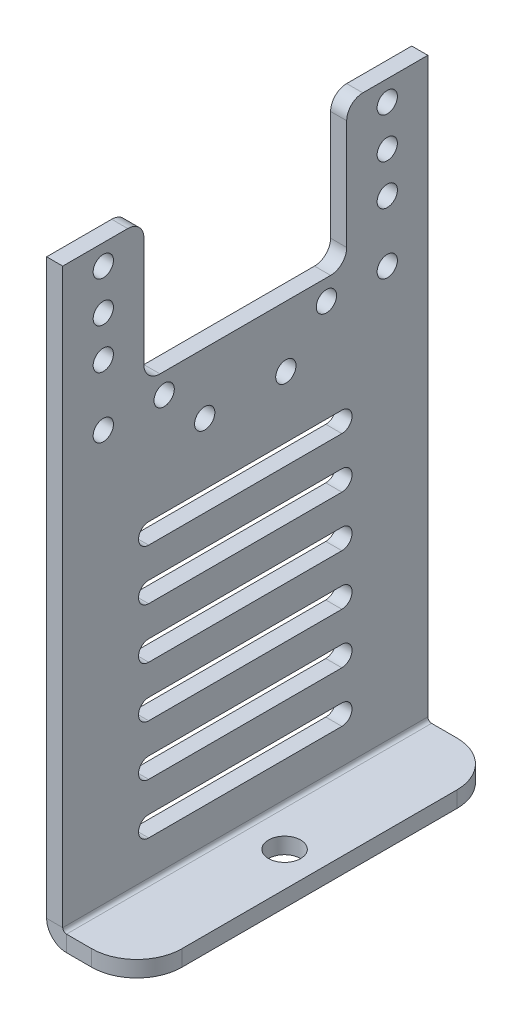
ISO-10303-21;
HEADER;
FILE_DESCRIPTION(('STEP AP214'),'2;1');
FILE_NAME('part.step','',(''),(''),'','','');
FILE_SCHEMA(('AUTOMOTIVE_DESIGN { 1 0 10303 214 1 1 1 1 }'));
ENDSEC;
DATA;
#1=APPLICATION_CONTEXT('core data for automotive mechanical design processes');
#2=APPLICATION_PROTOCOL_DEFINITION('international standard','automotive_design',2000,#1);
#3=PRODUCT_CONTEXT('',#1,'mechanical');
#4=PRODUCT('Part','Part','',(#3));
#5=PRODUCT_RELATED_PRODUCT_CATEGORY('part','',(#4));
#6=PRODUCT_DEFINITION_FORMATION('','',#4);
#7=PRODUCT_DEFINITION_CONTEXT('part definition',#1,'design');
#8=PRODUCT_DEFINITION('design','',#6,#7);
#9=PRODUCT_DEFINITION_SHAPE('','',#8);
#10=(LENGTH_UNIT() NAMED_UNIT(*) SI_UNIT(.MILLI.,.METRE.));
#11=(NAMED_UNIT(*) PLANE_ANGLE_UNIT() SI_UNIT($,.RADIAN.));
#12=(NAMED_UNIT(*) SI_UNIT($,.STERADIAN.) SOLID_ANGLE_UNIT());
#13=UNCERTAINTY_MEASURE_WITH_UNIT(LENGTH_MEASURE(1.E-05),#10,'distance_accuracy_value','');
#14=(GEOMETRIC_REPRESENTATION_CONTEXT(3) GLOBAL_UNCERTAINTY_ASSIGNED_CONTEXT((#13)) GLOBAL_UNIT_ASSIGNED_CONTEXT((#10,
#11,#12)) REPRESENTATION_CONTEXT('',''));
#15=CARTESIAN_POINT('',(0.,0.,0.));
#16=DIRECTION('',(0.,0.,1.));
#17=DIRECTION('',(1.,0.,0.));
#18=AXIS2_PLACEMENT_3D('',#15,#16,#17);
#19=CARTESIAN_POINT('',(27.175,3.175,-36.));
#20=DIRECTION('',(0.,0.,1.));
#21=DIRECTION('',(1.,0.,0.));
#22=AXIS2_PLACEMENT_3D('',#19,#20,#21);
#23=PLANE('',#22);
#24=DIRECTION('',(-1.,0.,0.));
#25=VECTOR('',#24,1.);
#26=CARTESIAN_POINT('',(27.175,3.175,-36.));
#27=LINE('',#26,#25);
#28=CARTESIAN_POINT('',(36.065,3.175,-36.));
#29=VERTEX_POINT('',#28);
#30=CARTESIAN_POINT('',(31.0866,3.175,-36.));
#31=VERTEX_POINT('',#30);
#32=EDGE_CURVE('E759',#29,#31,#27,.T.);
#33=ORIENTED_EDGE('',*,*,#32,.F.);
#34=DIRECTION('',(0.,-1.,0.));
#35=VECTOR('',#34,1.);
#36=CARTESIAN_POINT('',(36.065,3.175,-36.));
#37=LINE('',#36,#35);
#38=CARTESIAN_POINT('',(36.065,0.,-36.));
#39=VERTEX_POINT('',#38);
#40=EDGE_CURVE('E771',#29,#39,#37,.T.);
#41=ORIENTED_EDGE('',*,*,#40,.T.);
#42=DIRECTION('',(-1.,0.,0.));
#43=VECTOR('',#42,1.);
#44=CARTESIAN_POINT('',(27.175,0.,-36.));
#45=LINE('',#44,#43);
#46=CARTESIAN_POINT('',(31.0866,0.,-36.));
#47=VERTEX_POINT('',#46);
#48=EDGE_CURVE('E755',#39,#47,#45,.T.);
#49=ORIENTED_EDGE('',*,*,#48,.T.);
#50=DIRECTION('',(0.,-1.,0.));
#51=VECTOR('',#50,1.);
#52=CARTESIAN_POINT('',(31.0866,3.175,-36.));
#53=LINE('',#52,#51);
#54=EDGE_CURVE('E751',#31,#47,#53,.T.);
#55=ORIENTED_EDGE('',*,*,#54,.F.);
#56=EDGE_LOOP('',(#33,#41,#49,#55));
#57=FACE_BOUND('',#56,.T.);
#58=ADVANCED_FACE('F62',(#57),#23,.F.);
#59=CARTESIAN_POINT('',(44.955,3.175,36.));
#60=DIRECTION('',(0.,0.,-1.));
#61=DIRECTION('',(-1.,0.,0.));
#62=AXIS2_PLACEMENT_3D('',#59,#60,#61);
#63=PLANE('',#62);
#64=DIRECTION('',(1.,0.,0.));
#65=VECTOR('',#64,1.);
#66=CARTESIAN_POINT('',(44.955,0.,36.));
#67=LINE('',#66,#65);
#68=CARTESIAN_POINT('',(31.0866,0.,36.));
#69=VERTEX_POINT('',#68);
#70=CARTESIAN_POINT('',(36.065,0.,36.));
#71=VERTEX_POINT('',#70);
#72=EDGE_CURVE('E774',#69,#71,#67,.T.);
#73=ORIENTED_EDGE('',*,*,#72,.T.);
#74=DIRECTION('',(0.,-1.,0.));
#75=VECTOR('',#74,1.);
#76=CARTESIAN_POINT('',(36.065,3.175,36.));
#77=LINE('',#76,#75);
#78=CARTESIAN_POINT('',(36.065,3.175,36.));
#79=VERTEX_POINT('',#78);
#80=EDGE_CURVE('E803',#71,#79,#77,.F.);
#81=ORIENTED_EDGE('',*,*,#80,.T.);
#82=DIRECTION('',(1.,0.,0.));
#83=VECTOR('',#82,1.);
#84=CARTESIAN_POINT('',(44.955,3.175,36.));
#85=LINE('',#84,#83);
#86=CARTESIAN_POINT('',(31.0866,3.175,36.));
#87=VERTEX_POINT('',#86);
#88=EDGE_CURVE('E762',#87,#79,#85,.T.);
#89=ORIENTED_EDGE('',*,*,#88,.F.);
#90=DIRECTION('',(0.,-1.,0.));
#91=VECTOR('',#90,1.);
#92=CARTESIAN_POINT('',(31.0866,3.175,36.));
#93=LINE('',#92,#91);
#94=EDGE_CURVE('E736',#87,#69,#93,.T.);
#95=ORIENTED_EDGE('',*,*,#94,.T.);
#96=EDGE_LOOP('',(#73,#81,#89,#95));
#97=FACE_BOUND('',#96,.T.);
#98=ADVANCED_FACE('F872',(#97),#63,.F.);
#99=CARTESIAN_POINT('',(0.,3.175,0.));
#100=DIRECTION('',(0.,-1.,0.));
#101=DIRECTION('',(0.,0.,-1.));
#102=AXIS2_PLACEMENT_3D('',#99,#100,#101);
#103=PLANE('',#102);
#104=CARTESIAN_POINT('',(38.1,3.175,0.));
#105=DIRECTION('',(0.,-1.,0.));
#106=DIRECTION('',(0.,0.,-1.));
#107=AXIS2_PLACEMENT_3D('',#104,#105,#106);
#108=CIRCLE('',#107,3.175);
#109=CARTESIAN_POINT('',(38.1,3.175,-3.175));
#110=VERTEX_POINT('',#109);
#111=EDGE_CURVE('E694',#110,#110,#108,.F.);
#112=ORIENTED_EDGE('',*,*,#111,.F.);
#113=EDGE_LOOP('',(#112));
#114=FACE_BOUND('',#113,.T.);
#115=DIRECTION('',(0.,0.,-1.));
#116=VECTOR('',#115,1.);
#117=CARTESIAN_POINT('',(44.955,3.175,-36.));
#118=LINE('',#117,#116);
#119=CARTESIAN_POINT('',(44.955,3.175,27.11));
#120=VERTEX_POINT('',#119);
#121=CARTESIAN_POINT('',(44.955,3.175,-27.11));
#122=VERTEX_POINT('',#121);
#123=EDGE_CURVE('E767',#120,#122,#118,.T.);
#124=ORIENTED_EDGE('',*,*,#123,.T.);
#125=CARTESIAN_POINT('',(36.065,3.175,-27.11));
#126=DIRECTION('',(0.,-1.,0.));
#127=DIRECTION('',(0.,0.,-1.));
#128=AXIS2_PLACEMENT_3D('',#125,#126,#127);
#129=CIRCLE('',#128,8.89);
#130=EDGE_CURVE('E800',#122,#29,#129,.F.);
#131=ORIENTED_EDGE('',*,*,#130,.T.);
#132=ORIENTED_EDGE('',*,*,#32,.T.);
#133=DIRECTION('',(0.,0.,1.));
#134=VECTOR('',#133,1.);
#135=CARTESIAN_POINT('',(31.0866,3.175,36.));
#136=LINE('',#135,#134);
#137=EDGE_CURVE('E744',#87,#31,#136,.F.);
#138=ORIENTED_EDGE('',*,*,#137,.F.);
#139=ORIENTED_EDGE('',*,*,#88,.T.);
#140=CARTESIAN_POINT('',(36.065,3.175,27.11));
#141=DIRECTION('',(0.,-1.,0.));
#142=DIRECTION('',(0.,0.,-1.));
#143=AXIS2_PLACEMENT_3D('',#140,#141,#142);
#144=CIRCLE('',#143,8.89);
#145=EDGE_CURVE('E797',#79,#120,#144,.F.);
#146=ORIENTED_EDGE('',*,*,#145,.T.);
#147=EDGE_LOOP('',(#124,#131,#132,#138,#139,#146));
#148=FACE_BOUND('',#147,.T.);
#149=ADVANCED_FACE('F878',(#114,#148),#103,.F.);
#150=CARTESIAN_POINT('',(0.,0.,0.));
#151=DIRECTION('',(0.,-1.,0.));
#152=DIRECTION('',(0.,0.,-1.));
#153=AXIS2_PLACEMENT_3D('',#150,#151,#152);
#154=PLANE('',#153);
#155=CARTESIAN_POINT('',(38.1,0.,0.));
#156=DIRECTION('',(0.,1.,0.));
#157=DIRECTION('',(0.,0.,1.));
#158=AXIS2_PLACEMENT_3D('',#155,#156,#157);
#159=CIRCLE('',#158,3.175);
#160=CARTESIAN_POINT('',(38.1,0.,3.175));
#161=VERTEX_POINT('',#160);
#162=EDGE_CURVE('E681',#161,#161,#159,.T.);
#163=ORIENTED_EDGE('',*,*,#162,.T.);
#164=EDGE_LOOP('',(#163));
#165=FACE_BOUND('',#164,.T.);
#166=ORIENTED_EDGE('',*,*,#48,.F.);
#167=CARTESIAN_POINT('',(36.065,0.,-27.11));
#168=DIRECTION('',(0.,-1.,0.));
#169=DIRECTION('',(0.,0.,-1.));
#170=AXIS2_PLACEMENT_3D('',#167,#168,#169);
#171=CIRCLE('',#170,8.89);
#172=CARTESIAN_POINT('',(44.955,0.,-27.11));
#173=VERTEX_POINT('',#172);
#174=EDGE_CURVE('E787',#39,#173,#171,.T.);
#175=ORIENTED_EDGE('',*,*,#174,.T.);
#176=DIRECTION('',(0.,0.,-1.));
#177=VECTOR('',#176,1.);
#178=CARTESIAN_POINT('',(44.955,0.,-36.));
#179=LINE('',#178,#177);
#180=CARTESIAN_POINT('',(44.955,0.,27.11));
#181=VERTEX_POINT('',#180);
#182=EDGE_CURVE('E763',#181,#173,#179,.T.);
#183=ORIENTED_EDGE('',*,*,#182,.F.);
#184=CARTESIAN_POINT('',(36.065,0.,27.11));
#185=DIRECTION('',(0.,-1.,0.));
#186=DIRECTION('',(0.,0.,-1.));
#187=AXIS2_PLACEMENT_3D('',#184,#185,#186);
#188=CIRCLE('',#187,8.89);
#189=EDGE_CURVE('E784',#181,#71,#188,.T.);
#190=ORIENTED_EDGE('',*,*,#189,.T.);
#191=ORIENTED_EDGE('',*,*,#72,.F.);
#192=DIRECTION('',(0.,0.,1.));
#193=VECTOR('',#192,1.);
#194=CARTESIAN_POINT('',(31.0866,0.,36.));
#195=LINE('',#194,#193);
#196=EDGE_CURVE('E727',#69,#47,#195,.F.);
#197=ORIENTED_EDGE('',*,*,#196,.T.);
#198=EDGE_LOOP('',(#166,#175,#183,#190,#191,#197));
#199=FACE_BOUND('',#198,.T.);
#200=ADVANCED_FACE('F1542',(#165,#199),#154,.T.);
#201=CARTESIAN_POINT('',(44.955,3.175,-36.));
#202=DIRECTION('',(-1.,0.,0.));
#203=DIRECTION('',(0.,0.,1.));
#204=AXIS2_PLACEMENT_3D('',#201,#202,#203);
#205=PLANE('',#204);
#206=ORIENTED_EDGE('',*,*,#182,.T.);
#207=DIRECTION('',(0.,-1.,0.));
#208=VECTOR('',#207,1.);
#209=CARTESIAN_POINT('',(44.955,3.175,-27.11));
#210=LINE('',#209,#208);
#211=EDGE_CURVE('E794',#173,#122,#210,.F.);
#212=ORIENTED_EDGE('',*,*,#211,.T.);
#213=ORIENTED_EDGE('',*,*,#123,.F.);
#214=DIRECTION('',(0.,-1.,0.));
#215=VECTOR('',#214,1.);
#216=CARTESIAN_POINT('',(44.955,3.175,27.11));
#217=LINE('',#216,#215);
#218=EDGE_CURVE('E790',#120,#181,#217,.T.);
#219=ORIENTED_EDGE('',*,*,#218,.T.);
#220=EDGE_LOOP('',(#206,#212,#213,#219));
#221=FACE_BOUND('',#220,.T.);
#222=ADVANCED_FACE('F1515',(#221),#205,.F.);
#223=CARTESIAN_POINT('',(31.0866,3.9116,-36.));
#224=DIRECTION('',(0.,0.,-1.));
#225=DIRECTION('',(-1.,0.,0.));
#226=AXIS2_PLACEMENT_3D('',#223,#224,#225);
#227=PLANE('',#226);
#228=DIRECTION('',(1.,0.,0.));
#229=VECTOR('',#228,1.);
#230=CARTESIAN_POINT('',(27.175,3.91159999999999,-36.));
#231=LINE('',#230,#229);
#232=CARTESIAN_POINT('',(30.35,3.9116,-36.));
#233=VERTEX_POINT('',#232);
#234=CARTESIAN_POINT('',(27.175,3.91159999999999,-36.));
#235=VERTEX_POINT('',#234);
#236=EDGE_CURVE('E698',#233,#235,#231,.F.);
#237=ORIENTED_EDGE('',*,*,#236,.F.);
#238=CARTESIAN_POINT('',(31.0866,3.9116,-36.));
#239=DIRECTION('',(0.,0.,1.));
#240=DIRECTION('',(1.,0.,0.));
#241=AXIS2_PLACEMENT_3D('',#238,#239,#240);
#242=CIRCLE('',#241,0.7366);
#243=EDGE_CURVE('E740',#31,#233,#242,.F.);
#244=ORIENTED_EDGE('',*,*,#243,.F.);
#245=ORIENTED_EDGE('',*,*,#54,.T.);
#246=CARTESIAN_POINT('',(31.0866,3.9116,-36.));
#247=DIRECTION('',(0.,0.,1.));
#248=DIRECTION('',(1.,0.,0.));
#249=AXIS2_PLACEMENT_3D('',#246,#247,#248);
#250=CIRCLE('',#249,3.9116);
#251=EDGE_CURVE('E731',#47,#235,#250,.F.);
#252=ORIENTED_EDGE('',*,*,#251,.T.);
#253=EDGE_LOOP('',(#237,#244,#245,#252));
#254=FACE_BOUND('',#253,.T.);
#255=ADVANCED_FACE('F1503',(#254),#227,.T.);
#256=CARTESIAN_POINT('',(31.0866,3.9116,36.));
#257=DIRECTION('',(0.,0.,-1.));
#258=DIRECTION('',(-1.,0.,0.));
#259=AXIS2_PLACEMENT_3D('',#256,#257,#258);
#260=PLANE('',#259);
#261=CARTESIAN_POINT('',(31.0866,3.9116,36.));
#262=DIRECTION('',(0.,0.,1.));
#263=DIRECTION('',(1.,0.,0.));
#264=AXIS2_PLACEMENT_3D('',#261,#262,#263);
#265=CIRCLE('',#264,0.7366);
#266=CARTESIAN_POINT('',(30.35,3.9116,36.));
#267=VERTEX_POINT('',#266);
#268=EDGE_CURVE('E701',#267,#87,#265,.T.);
#269=ORIENTED_EDGE('',*,*,#268,.F.);
#270=DIRECTION('',(1.,0.,0.));
#271=VECTOR('',#270,1.);
#272=CARTESIAN_POINT('',(30.35,3.9116,36.));
#273=LINE('',#272,#271);
#274=CARTESIAN_POINT('',(27.175,3.91159999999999,36.));
#275=VERTEX_POINT('',#274);
#276=EDGE_CURVE('E717',#267,#275,#273,.F.);
#277=ORIENTED_EDGE('',*,*,#276,.T.);
#278=CARTESIAN_POINT('',(31.0866,3.9116,36.));
#279=DIRECTION('',(0.,0.,1.));
#280=DIRECTION('',(1.,0.,0.));
#281=AXIS2_PLACEMENT_3D('',#278,#279,#280);
#282=CIRCLE('',#281,3.9116);
#283=EDGE_CURVE('E732',#275,#69,#282,.T.);
#284=ORIENTED_EDGE('',*,*,#283,.T.);
#285=ORIENTED_EDGE('',*,*,#94,.F.);
#286=EDGE_LOOP('',(#269,#277,#284,#285));
#287=FACE_BOUND('',#286,.T.);
#288=ADVANCED_FACE('F1491',(#287),#260,.F.);
#289=CARTESIAN_POINT('',(31.0866,3.9116,36.));
#290=DIRECTION('',(0.,0.,1.));
#291=DIRECTION('',(-1.,0.,0.));
#292=AXIS2_PLACEMENT_3D('',#289,#290,#291);
#293=CYLINDRICAL_SURFACE('',#292,3.9116);
#294=ORIENTED_EDGE('',*,*,#196,.F.);
#295=ORIENTED_EDGE('',*,*,#283,.F.);
#296=DIRECTION('',(0.,0.,1.));
#297=VECTOR('',#296,1.);
#298=CARTESIAN_POINT('',(27.175,3.91159999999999,-36.));
#299=LINE('',#298,#297);
#300=EDGE_CURVE('E342',#275,#235,#299,.F.);
#301=ORIENTED_EDGE('',*,*,#300,.T.);
#302=ORIENTED_EDGE('',*,*,#251,.F.);
#303=EDGE_LOOP('',(#294,#295,#301,#302));
#304=FACE_BOUND('',#303,.T.);
#305=ADVANCED_FACE('F1479',(#304),#293,.T.);
#306=CARTESIAN_POINT('',(31.0866,3.9116,36.));
#307=DIRECTION('',(0.,0.,1.));
#308=DIRECTION('',(-1.,0.,0.));
#309=AXIS2_PLACEMENT_3D('',#306,#307,#308);
#310=CYLINDRICAL_SURFACE('',#309,0.7366);
#311=ORIENTED_EDGE('',*,*,#137,.T.);
#312=ORIENTED_EDGE('',*,*,#243,.T.);
#313=DIRECTION('',(0.,0.,1.));
#314=VECTOR('',#313,1.);
#315=CARTESIAN_POINT('',(30.35,3.9116,-36.));
#316=LINE('',#315,#314);
#317=EDGE_CURVE('E721',#233,#267,#316,.T.);
#318=ORIENTED_EDGE('',*,*,#317,.T.);
#319=ORIENTED_EDGE('',*,*,#268,.T.);
#320=EDGE_LOOP('',(#311,#312,#318,#319));
#321=FACE_BOUND('',#320,.T.);
#322=ADVANCED_FACE('F1468',(#321),#310,.F.);
#323=CARTESIAN_POINT('',(27.175,3.17499999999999,-36.));
#324=DIRECTION('',(0.,0.,1.));
#325=DIRECTION('',(0.,-1.,0.));
#326=AXIS2_PLACEMENT_3D('',#323,#324,#325);
#327=PLANE('',#326);
#328=ORIENTED_EDGE('',*,*,#236,.T.);
#329=DIRECTION('',(0.,-1.,0.));
#330=VECTOR('',#329,1.);
#331=CARTESIAN_POINT('',(27.175,0.,-36.));
#332=LINE('',#331,#330);
#333=CARTESIAN_POINT('',(27.1749999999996,116.9,-36.));
#334=VERTEX_POINT('',#333);
#335=EDGE_CURVE('E347',#334,#235,#332,.T.);
#336=ORIENTED_EDGE('',*,*,#335,.F.);
#337=DIRECTION('',(-1.,0.,0.));
#338=VECTOR('',#337,1.);
#339=CARTESIAN_POINT('',(30.3499999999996,116.9,-36.));
#340=LINE('',#339,#338);
#341=CARTESIAN_POINT('',(30.3499999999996,116.9,-36.));
#342=VERTEX_POINT('',#341);
#343=EDGE_CURVE('E387',#342,#334,#340,.T.);
#344=ORIENTED_EDGE('',*,*,#343,.F.);
#345=DIRECTION('',(0.,1.,0.));
#346=VECTOR('',#345,1.);
#347=CARTESIAN_POINT('',(30.35,3.175,-36.));
#348=LINE('',#347,#346);
#349=EDGE_CURVE('E711',#342,#233,#348,.F.);
#350=ORIENTED_EDGE('',*,*,#349,.T.);
#351=EDGE_LOOP('',(#328,#336,#344,#350));
#352=FACE_BOUND('',#351,.T.);
#353=ADVANCED_FACE('F1457',(#352),#327,.F.);
#354=CARTESIAN_POINT('',(27.1749999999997,88.9,36.));
#355=DIRECTION('',(0.,0.,-1.));
#356=DIRECTION('',(0.,1.,0.));
#357=AXIS2_PLACEMENT_3D('',#354,#355,#356);
#358=PLANE('',#357);
#359=ORIENTED_EDGE('',*,*,#276,.F.);
#360=DIRECTION('',(0.,-1.,0.));
#361=VECTOR('',#360,1.);
#362=CARTESIAN_POINT('',(30.3499999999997,88.9,36.));
#363=LINE('',#362,#361);
#364=CARTESIAN_POINT('',(30.3499999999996,116.9,36.));
#365=VERTEX_POINT('',#364);
#366=EDGE_CURVE('E353',#267,#365,#363,.F.);
#367=ORIENTED_EDGE('',*,*,#366,.T.);
#368=DIRECTION('',(-1.,0.,0.));
#369=VECTOR('',#368,1.);
#370=CARTESIAN_POINT('',(30.3499999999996,116.9,36.));
#371=LINE('',#370,#369);
#372=CARTESIAN_POINT('',(27.1749999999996,116.9,36.));
#373=VERTEX_POINT('',#372);
#374=EDGE_CURVE('E350',#365,#373,#371,.T.);
#375=ORIENTED_EDGE('',*,*,#374,.T.);
#376=DIRECTION('',(0.,1.,0.));
#377=VECTOR('',#376,1.);
#378=CARTESIAN_POINT('',(27.175,0.,36.));
#379=LINE('',#378,#377);
#380=EDGE_CURVE('E335',#275,#373,#379,.T.);
#381=ORIENTED_EDGE('',*,*,#380,.F.);
#382=EDGE_LOOP('',(#359,#367,#375,#381));
#383=FACE_BOUND('',#382,.T.);
#384=ADVANCED_FACE('F351',(#383),#358,.F.);
#385=CARTESIAN_POINT('',(27.175,0.,0.));
#386=DIRECTION('',(1.,0.,0.));
#387=DIRECTION('',(0.,1.,0.));
#388=AXIS2_PLACEMENT_3D('',#385,#386,#387);
#389=PLANE('',#388);
#390=CARTESIAN_POINT('',(27.1749999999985,84.9,-28.));
#391=DIRECTION('',(-1.,0.,0.));
#392=DIRECTION('',(0.,1.,0.));
#393=AXIS2_PLACEMENT_3D('',#390,#391,#392);
#394=CIRCLE('',#393,2.);
#395=CARTESIAN_POINT('',(27.1749999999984,86.9,-28.));
#396=VERTEX_POINT('',#395);
#397=EDGE_CURVE('E1734',#396,#396,#394,.T.);
#398=ORIENTED_EDGE('',*,*,#397,.F.);
#399=EDGE_LOOP('',(#398));
#400=FACE_BOUND('',#399,.T.);
#401=CARTESIAN_POINT('',(27.1749999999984,96.9,-28.));
#402=DIRECTION('',(-1.,0.,0.));
#403=DIRECTION('',(0.,1.,0.));
#404=AXIS2_PLACEMENT_3D('',#401,#402,#403);
#405=CIRCLE('',#404,2.);
#406=CARTESIAN_POINT('',(27.1749999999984,98.9,-28.));
#407=VERTEX_POINT('',#406);
#408=EDGE_CURVE('E1738',#407,#407,#405,.T.);
#409=ORIENTED_EDGE('',*,*,#408,.F.);
#410=EDGE_LOOP('',(#409));
#411=FACE_BOUND('',#410,.T.);
#412=CARTESIAN_POINT('',(27.1749999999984,104.9,-28.));
#413=DIRECTION('',(-1.,0.,0.));
#414=DIRECTION('',(0.,1.,0.));
#415=AXIS2_PLACEMENT_3D('',#412,#413,#414);
#416=CIRCLE('',#415,2.);
#417=CARTESIAN_POINT('',(27.1749999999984,106.9,-28.));
#418=VERTEX_POINT('',#417);
#419=EDGE_CURVE('E1742',#418,#418,#416,.T.);
#420=ORIENTED_EDGE('',*,*,#419,.F.);
#421=EDGE_LOOP('',(#420));
#422=FACE_BOUND('',#421,.T.);
#423=CARTESIAN_POINT('',(27.1749999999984,112.9,-28.));
#424=DIRECTION('',(-1.,0.,0.));
#425=DIRECTION('',(0.,1.,0.));
#426=AXIS2_PLACEMENT_3D('',#423,#424,#425);
#427=CIRCLE('',#426,2.);
#428=CARTESIAN_POINT('',(27.1749999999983,114.9,-28.));
#429=VERTEX_POINT('',#428);
#430=EDGE_CURVE('E1746',#429,#429,#427,.T.);
#431=ORIENTED_EDGE('',*,*,#430,.F.);
#432=EDGE_LOOP('',(#431));
#433=FACE_BOUND('',#432,.T.);
#434=CARTESIAN_POINT('',(27.1749999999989,84.9,28.));
#435=DIRECTION('',(1.,0.,0.));
#436=DIRECTION('',(0.,1.,0.));
#437=AXIS2_PLACEMENT_3D('',#434,#435,#436);
#438=CIRCLE('',#437,2.);
#439=CARTESIAN_POINT('',(27.1749999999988,86.9,28.));
#440=VERTEX_POINT('',#439);
#441=EDGE_CURVE('E357',#440,#440,#438,.T.);
#442=ORIENTED_EDGE('',*,*,#441,.T.);
#443=EDGE_LOOP('',(#442));
#444=FACE_BOUND('',#443,.T.);
#445=CARTESIAN_POINT('',(27.1749999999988,96.9,28.));
#446=DIRECTION('',(1.,0.,0.));
#447=DIRECTION('',(0.,1.,0.));
#448=AXIS2_PLACEMENT_3D('',#445,#446,#447);
#449=CIRCLE('',#448,2.);
#450=CARTESIAN_POINT('',(27.1749999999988,98.9,28.));
#451=VERTEX_POINT('',#450);
#452=EDGE_CURVE('E1753',#451,#451,#449,.T.);
#453=ORIENTED_EDGE('',*,*,#452,.T.);
#454=EDGE_LOOP('',(#453));
#455=FACE_BOUND('',#454,.T.);
#456=CARTESIAN_POINT('',(27.1749999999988,104.9,28.));
#457=DIRECTION('',(1.,0.,0.));
#458=DIRECTION('',(0.,1.,0.));
#459=AXIS2_PLACEMENT_3D('',#456,#457,#458);
#460=CIRCLE('',#459,2.);
#461=CARTESIAN_POINT('',(27.1749999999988,106.9,28.));
#462=VERTEX_POINT('',#461);
#463=EDGE_CURVE('E1757',#462,#462,#460,.T.);
#464=ORIENTED_EDGE('',*,*,#463,.T.);
#465=EDGE_LOOP('',(#464));
#466=FACE_BOUND('',#465,.T.);
#467=CARTESIAN_POINT('',(27.1749999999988,112.9,28.));
#468=DIRECTION('',(1.,0.,0.));
#469=DIRECTION('',(0.,1.,0.));
#470=AXIS2_PLACEMENT_3D('',#467,#468,#469);
#471=CIRCLE('',#470,2.);
#472=CARTESIAN_POINT('',(27.1749999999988,114.9,28.));
#473=VERTEX_POINT('',#472);
#474=EDGE_CURVE('E1761',#473,#473,#471,.T.);
#475=ORIENTED_EDGE('',*,*,#474,.T.);
#476=EDGE_LOOP('',(#475));
#477=FACE_BOUND('',#476,.T.);
#478=CARTESIAN_POINT('',(27.1749999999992,76.9,-7.99999999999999));
#479=DIRECTION('',(1.,0.,0.));
#480=DIRECTION('',(0.,1.,0.));
#481=AXIS2_PLACEMENT_3D('',#478,#479,#480);
#482=CIRCLE('',#481,2.);
#483=CARTESIAN_POINT('',(27.1749999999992,78.9,-7.99999999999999));
#484=VERTEX_POINT('',#483);
#485=EDGE_CURVE('E394',#484,#484,#482,.T.);
#486=ORIENTED_EDGE('',*,*,#485,.T.);
#487=EDGE_LOOP('',(#486));
#488=FACE_BOUND('',#487,.T.);
#489=CARTESIAN_POINT('',(27.1749999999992,84.9,16.));
#490=DIRECTION('',(1.,0.,0.));
#491=DIRECTION('',(0.,1.,0.));
#492=AXIS2_PLACEMENT_3D('',#489,#490,#491);
#493=CIRCLE('',#492,2.);
#494=CARTESIAN_POINT('',(27.1749999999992,86.9,16.));
#495=VERTEX_POINT('',#494);
#496=EDGE_CURVE('E408',#495,#495,#493,.T.);
#497=ORIENTED_EDGE('',*,*,#496,.T.);
#498=EDGE_LOOP('',(#497));
#499=FACE_BOUND('',#498,.T.);
#500=CARTESIAN_POINT('',(27.1749999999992,84.9,-16.));
#501=DIRECTION('',(1.,0.,0.));
#502=DIRECTION('',(0.,1.,0.));
#503=AXIS2_PLACEMENT_3D('',#500,#501,#502);
#504=CIRCLE('',#503,2.00000000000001);
#505=CARTESIAN_POINT('',(27.1749999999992,86.9,-16.));
#506=VERTEX_POINT('',#505);
#507=EDGE_CURVE('E400',#506,#506,#504,.T.);
#508=ORIENTED_EDGE('',*,*,#507,.T.);
#509=EDGE_LOOP('',(#508));
#510=FACE_BOUND('',#509,.T.);
#511=CARTESIAN_POINT('',(27.1749999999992,76.9,8.00000000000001));
#512=DIRECTION('',(1.,0.,0.));
#513=DIRECTION('',(0.,1.,0.));
#514=AXIS2_PLACEMENT_3D('',#511,#512,#513);
#515=CIRCLE('',#514,2.);
#516=CARTESIAN_POINT('',(27.1749999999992,78.9,8.00000000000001));
#517=VERTEX_POINT('',#516);
#518=EDGE_CURVE('E419',#517,#517,#515,.T.);
#519=ORIENTED_EDGE('',*,*,#518,.T.);
#520=EDGE_LOOP('',(#519));
#521=FACE_BOUND('',#520,.T.);
#522=DIRECTION('',(0.,0.,1.));
#523=VECTOR('',#522,1.);
#524=CARTESIAN_POINT('',(27.1749999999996,14.7665,19.05));
#525=LINE('',#524,#523);
#526=CARTESIAN_POINT('',(27.1749999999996,14.7665,-19.05));
#527=VERTEX_POINT('',#526);
#528=CARTESIAN_POINT('',(27.1749999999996,14.7665,19.05));
#529=VERTEX_POINT('',#528);
#530=EDGE_CURVE('E593',#527,#529,#525,.T.);
#531=ORIENTED_EDGE('',*,*,#530,.T.);
#532=CARTESIAN_POINT('',(27.1749999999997,12.7665,19.05));
#533=DIRECTION('',(1.,0.,0.));
#534=DIRECTION('',(0.,1.,0.));
#535=AXIS2_PLACEMENT_3D('',#532,#533,#534);
#536=CIRCLE('',#535,2.00000000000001);
#537=CARTESIAN_POINT('',(27.1749999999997,10.7665,19.05));
#538=VERTEX_POINT('',#537);
#539=EDGE_CURVE('E431',#529,#538,#536,.T.);
#540=ORIENTED_EDGE('',*,*,#539,.T.);
#541=DIRECTION('',(0.,0.,-1.));
#542=VECTOR('',#541,1.);
#543=CARTESIAN_POINT('',(27.1749999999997,10.7665,19.05));
#544=LINE('',#543,#542);
#545=CARTESIAN_POINT('',(27.175,10.7665,-19.05));
#546=VERTEX_POINT('',#545);
#547=EDGE_CURVE('E563',#538,#546,#544,.T.);
#548=ORIENTED_EDGE('',*,*,#547,.T.);
#549=CARTESIAN_POINT('',(27.1749999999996,12.7665,-19.05));
#550=DIRECTION('',(1.,0.,0.));
#551=DIRECTION('',(0.,1.,0.));
#552=AXIS2_PLACEMENT_3D('',#549,#550,#551);
#553=CIRCLE('',#552,2.00000000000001);
#554=EDGE_CURVE('E582',#546,#527,#553,.T.);
#555=ORIENTED_EDGE('',*,*,#554,.T.);
#556=EDGE_LOOP('',(#531,#540,#548,#555));
#557=FACE_BOUND('',#556,.T.);
#558=DIRECTION('',(0.,0.,1.));
#559=VECTOR('',#558,1.);
#560=CARTESIAN_POINT('',(27.1749999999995,64.7665,19.05));
#561=LINE('',#560,#559);
#562=CARTESIAN_POINT('',(27.1749999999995,64.7665,-19.05));
#563=VERTEX_POINT('',#562);
#564=CARTESIAN_POINT('',(27.1749999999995,64.7665,19.05));
#565=VERTEX_POINT('',#564);
#566=EDGE_CURVE('E507',#563,#565,#561,.T.);
#567=ORIENTED_EDGE('',*,*,#566,.T.);
#568=CARTESIAN_POINT('',(27.1749999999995,62.7665,19.05));
#569=DIRECTION('',(1.,0.,0.));
#570=DIRECTION('',(0.,1.,0.));
#571=AXIS2_PLACEMENT_3D('',#568,#569,#570);
#572=CIRCLE('',#571,2.00000000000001);
#573=CARTESIAN_POINT('',(27.1749999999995,60.7665,19.05));
#574=VERTEX_POINT('',#573);
#575=EDGE_CURVE('E514',#565,#574,#572,.T.);
#576=ORIENTED_EDGE('',*,*,#575,.T.);
#577=DIRECTION('',(0.,0.,-1.));
#578=VECTOR('',#577,1.);
#579=CARTESIAN_POINT('',(27.1749999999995,60.7665,19.05));
#580=LINE('',#579,#578);
#581=CARTESIAN_POINT('',(27.1749999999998,60.7665,-19.05));
#582=VERTEX_POINT('',#581);
#583=EDGE_CURVE('E476',#574,#582,#580,.T.);
#584=ORIENTED_EDGE('',*,*,#583,.T.);
#585=CARTESIAN_POINT('',(27.1749999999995,62.7665,-19.05));
#586=DIRECTION('',(1.,0.,0.));
#587=DIRECTION('',(0.,1.,0.));
#588=AXIS2_PLACEMENT_3D('',#585,#586,#587);
#589=CIRCLE('',#588,2.00000000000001);
#590=EDGE_CURVE('E496',#582,#563,#589,.T.);
#591=ORIENTED_EDGE('',*,*,#590,.T.);
#592=EDGE_LOOP('',(#567,#576,#584,#591));
#593=FACE_BOUND('',#592,.T.);
#594=DIRECTION('',(0.,0.,1.));
#595=VECTOR('',#594,1.);
#596=CARTESIAN_POINT('',(27.1749999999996,34.7665,19.05));
#597=LINE('',#596,#595);
#598=CARTESIAN_POINT('',(27.1749999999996,34.7665,-19.05));
#599=VERTEX_POINT('',#598);
#600=CARTESIAN_POINT('',(27.1749999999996,34.7665,19.05));
#601=VERTEX_POINT('',#600);
#602=EDGE_CURVE('E551',#599,#601,#597,.T.);
#603=ORIENTED_EDGE('',*,*,#602,.T.);
#604=CARTESIAN_POINT('',(27.1749999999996,32.7665,19.05));
#605=DIRECTION('',(1.,0.,0.));
#606=DIRECTION('',(0.,1.,0.));
#607=AXIS2_PLACEMENT_3D('',#604,#605,#606);
#608=CIRCLE('',#607,2.00000000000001);
#609=CARTESIAN_POINT('',(27.1749999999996,30.7665,19.05));
#610=VERTEX_POINT('',#609);
#611=EDGE_CURVE('E477',#601,#610,#608,.T.);
#612=ORIENTED_EDGE('',*,*,#611,.T.);
#613=DIRECTION('',(0.,0.,-1.));
#614=VECTOR('',#613,1.);
#615=CARTESIAN_POINT('',(27.1749999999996,30.7665,19.05));
#616=LINE('',#615,#614);
#617=CARTESIAN_POINT('',(27.1749999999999,30.7665,-19.05));
#618=VERTEX_POINT('',#617);
#619=EDGE_CURVE('E521',#610,#618,#616,.T.);
#620=ORIENTED_EDGE('',*,*,#619,.T.);
#621=CARTESIAN_POINT('',(27.1749999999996,32.7665,-19.05));
#622=DIRECTION('',(1.,0.,0.));
#623=DIRECTION('',(0.,1.,0.));
#624=AXIS2_PLACEMENT_3D('',#621,#622,#623);
#625=CIRCLE('',#624,2.00000000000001);
#626=EDGE_CURVE('E540',#618,#599,#625,.T.);
#627=ORIENTED_EDGE('',*,*,#626,.T.);
#628=EDGE_LOOP('',(#603,#612,#620,#627));
#629=FACE_BOUND('',#628,.T.);
#630=DIRECTION('',(0.,0.,1.));
#631=VECTOR('',#630,1.);
#632=CARTESIAN_POINT('',(27.1749999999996,24.7665,19.05));
#633=LINE('',#632,#631);
#634=CARTESIAN_POINT('',(27.1749999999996,24.7665,-19.05));
#635=VERTEX_POINT('',#634);
#636=CARTESIAN_POINT('',(27.1749999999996,24.7665,19.05));
#637=VERTEX_POINT('',#636);
#638=EDGE_CURVE('E461',#635,#637,#633,.T.);
#639=ORIENTED_EDGE('',*,*,#638,.T.);
#640=CARTESIAN_POINT('',(27.1749999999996,22.7665,19.05));
#641=DIRECTION('',(1.,0.,0.));
#642=DIRECTION('',(0.,1.,0.));
#643=AXIS2_PLACEMENT_3D('',#640,#641,#642);
#644=CIRCLE('',#643,2.00000000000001);
#645=CARTESIAN_POINT('',(27.1749999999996,20.7665,19.05));
#646=VERTEX_POINT('',#645);
#647=EDGE_CURVE('E468',#637,#646,#644,.T.);
#648=ORIENTED_EDGE('',*,*,#647,.T.);
#649=DIRECTION('',(0.,0.,-1.));
#650=VECTOR('',#649,1.);
#651=CARTESIAN_POINT('',(27.1749999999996,20.7665,19.05));
#652=LINE('',#651,#650);
#653=CARTESIAN_POINT('',(27.1749999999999,20.7665,-19.05));
#654=VERTEX_POINT('',#653);
#655=EDGE_CURVE('E430',#646,#654,#652,.T.);
#656=ORIENTED_EDGE('',*,*,#655,.T.);
#657=CARTESIAN_POINT('',(27.1749999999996,22.7665,-19.05));
#658=DIRECTION('',(1.,0.,0.));
#659=DIRECTION('',(0.,1.,0.));
#660=AXIS2_PLACEMENT_3D('',#657,#658,#659);
#661=CIRCLE('',#660,2.00000000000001);
#662=EDGE_CURVE('E450',#654,#635,#661,.T.);
#663=ORIENTED_EDGE('',*,*,#662,.T.);
#664=EDGE_LOOP('',(#639,#648,#656,#663));
#665=FACE_BOUND('',#664,.T.);
#666=DIRECTION('',(0.,0.,1.));
#667=VECTOR('',#666,1.);
#668=CARTESIAN_POINT('',(27.1749999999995,54.7665,19.05));
#669=LINE('',#668,#667);
#670=CARTESIAN_POINT('',(27.1749999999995,54.7665,-19.05));
#671=VERTEX_POINT('',#670);
#672=CARTESIAN_POINT('',(27.1749999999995,54.7665,19.05));
#673=VERTEX_POINT('',#672);
#674=EDGE_CURVE('E635',#671,#673,#669,.T.);
#675=ORIENTED_EDGE('',*,*,#674,.T.);
#676=CARTESIAN_POINT('',(27.1749999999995,52.7665,19.05));
#677=DIRECTION('',(1.,0.,0.));
#678=DIRECTION('',(0.,1.,0.));
#679=AXIS2_PLACEMENT_3D('',#676,#677,#678);
#680=CIRCLE('',#679,2.00000000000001);
#681=CARTESIAN_POINT('',(27.1749999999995,50.7665,19.05));
#682=VERTEX_POINT('',#681);
#683=EDGE_CURVE('E642',#673,#682,#680,.T.);
#684=ORIENTED_EDGE('',*,*,#683,.T.);
#685=DIRECTION('',(0.,0.,-1.));
#686=VECTOR('',#685,1.);
#687=CARTESIAN_POINT('',(27.1749999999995,50.7665,19.05));
#688=LINE('',#687,#686);
#689=CARTESIAN_POINT('',(27.1749999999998,50.7665,-19.05));
#690=VERTEX_POINT('',#689);
#691=EDGE_CURVE('E605',#682,#690,#688,.T.);
#692=ORIENTED_EDGE('',*,*,#691,.T.);
#693=CARTESIAN_POINT('',(27.1749999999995,52.7665,-19.05));
#694=DIRECTION('',(1.,0.,0.));
#695=DIRECTION('',(0.,1.,0.));
#696=AXIS2_PLACEMENT_3D('',#693,#694,#695);
#697=CIRCLE('',#696,2.00000000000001);
#698=EDGE_CURVE('E624',#690,#671,#697,.T.);
#699=ORIENTED_EDGE('',*,*,#698,.T.);
#700=EDGE_LOOP('',(#675,#684,#692,#699));
#701=FACE_BOUND('',#700,.T.);
#702=DIRECTION('',(0.,0.,1.));
#703=VECTOR('',#702,1.);
#704=CARTESIAN_POINT('',(27.1749999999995,44.7665,19.05));
#705=LINE('',#704,#703);
#706=CARTESIAN_POINT('',(27.1749999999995,44.7665,-19.05));
#707=VERTEX_POINT('',#706);
#708=CARTESIAN_POINT('',(27.1749999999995,44.7665,19.05));
#709=VERTEX_POINT('',#708);
#710=EDGE_CURVE('E660',#707,#709,#705,.T.);
#711=ORIENTED_EDGE('',*,*,#710,.T.);
#712=CARTESIAN_POINT('',(27.1749999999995,42.7665,19.05));
#713=DIRECTION('',(1.,0.,0.));
#714=DIRECTION('',(0.,1.,0.));
#715=AXIS2_PLACEMENT_3D('',#712,#713,#714);
#716=CIRCLE('',#715,2.00000000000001);
#717=CARTESIAN_POINT('',(27.1749999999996,40.7665,19.05));
#718=VERTEX_POINT('',#717);
#719=EDGE_CURVE('E647',#709,#718,#716,.T.);
#720=ORIENTED_EDGE('',*,*,#719,.T.);
#721=DIRECTION('',(0.,0.,-1.));
#722=VECTOR('',#721,1.);
#723=CARTESIAN_POINT('',(27.1749999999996,40.7665,19.05));
#724=LINE('',#723,#722);
#725=CARTESIAN_POINT('',(27.1749999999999,40.7665,-19.05));
#726=VERTEX_POINT('',#725);
#727=EDGE_CURVE('E651',#718,#726,#724,.T.);
#728=ORIENTED_EDGE('',*,*,#727,.T.);
#729=CARTESIAN_POINT('',(27.1749999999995,42.7665,-19.05));
#730=DIRECTION('',(1.,0.,0.));
#731=DIRECTION('',(0.,1.,0.));
#732=AXIS2_PLACEMENT_3D('',#729,#730,#731);
#733=CIRCLE('',#732,2.00000000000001);
#734=EDGE_CURVE('E656',#726,#707,#733,.T.);
#735=ORIENTED_EDGE('',*,*,#734,.T.);
#736=EDGE_LOOP('',(#711,#720,#728,#735));
#737=FACE_BOUND('',#736,.T.);
#738=DIRECTION('',(0.,1.,0.));
#739=VECTOR('',#738,1.);
#740=CARTESIAN_POINT('',(27.1749999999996,116.9,-20.));
#741=LINE('',#740,#739);
#742=CARTESIAN_POINT('',(27.1749999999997,92.075,-20.));
#743=VERTEX_POINT('',#742);
#744=CARTESIAN_POINT('',(27.1749999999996,113.725,-20.));
#745=VERTEX_POINT('',#744);
#746=EDGE_CURVE('E364',#743,#745,#741,.T.);
#747=ORIENTED_EDGE('',*,*,#746,.T.);
#748=CARTESIAN_POINT('',(27.1749999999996,113.725,-23.175));
#749=DIRECTION('',(1.,0.,0.));
#750=DIRECTION('',(0.,1.,0.));
#751=AXIS2_PLACEMENT_3D('',#748,#749,#750);
#752=CIRCLE('',#751,3.175);
#753=CARTESIAN_POINT('',(27.1749999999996,116.9,-23.175));
#754=VERTEX_POINT('',#753);
#755=EDGE_CURVE('E830',#745,#754,#752,.F.);
#756=ORIENTED_EDGE('',*,*,#755,.T.);
#757=DIRECTION('',(0.,0.,-1.));
#758=VECTOR('',#757,1.);
#759=CARTESIAN_POINT('',(27.1749999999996,116.9,-36.));
#760=LINE('',#759,#758);
#761=EDGE_CURVE('E370',#754,#334,#760,.T.);
#762=ORIENTED_EDGE('',*,*,#761,.T.);
#763=ORIENTED_EDGE('',*,*,#335,.T.);
#764=ORIENTED_EDGE('',*,*,#300,.F.);
#765=ORIENTED_EDGE('',*,*,#380,.T.);
#766=DIRECTION('',(0.,0.,-1.));
#767=VECTOR('',#766,1.);
#768=CARTESIAN_POINT('',(27.1749999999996,116.9,20.));
#769=LINE('',#768,#767);
#770=CARTESIAN_POINT('',(27.1749999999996,116.9,23.175));
#771=VERTEX_POINT('',#770);
#772=EDGE_CURVE('E340',#373,#771,#769,.T.);
#773=ORIENTED_EDGE('',*,*,#772,.T.);
#774=CARTESIAN_POINT('',(27.1749999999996,113.725,23.175));
#775=DIRECTION('',(1.,0.,0.));
#776=DIRECTION('',(0.,1.,0.));
#777=AXIS2_PLACEMENT_3D('',#774,#775,#776);
#778=CIRCLE('',#777,3.175);
#779=CARTESIAN_POINT('',(27.1749999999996,113.725,20.));
#780=VERTEX_POINT('',#779);
#781=EDGE_CURVE('E827',#771,#780,#778,.F.);
#782=ORIENTED_EDGE('',*,*,#781,.T.);
#783=DIRECTION('',(0.,-1.,0.));
#784=VECTOR('',#783,1.);
#785=CARTESIAN_POINT('',(27.1749999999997,88.9,20.));
#786=LINE('',#785,#784);
#787=CARTESIAN_POINT('',(27.1749999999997,92.075,20.));
#788=VERTEX_POINT('',#787);
#789=EDGE_CURVE('E365',#780,#788,#786,.T.);
#790=ORIENTED_EDGE('',*,*,#789,.T.);
#791=CARTESIAN_POINT('',(27.1749999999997,92.075,16.825));
#792=DIRECTION('',(1.,0.,0.));
#793=DIRECTION('',(0.,1.,0.));
#794=AXIS2_PLACEMENT_3D('',#791,#792,#793);
#795=CIRCLE('',#794,3.175);
#796=CARTESIAN_POINT('',(27.1749999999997,88.9,16.825));
#797=VERTEX_POINT('',#796);
#798=EDGE_CURVE('E71',#788,#797,#795,.T.);
#799=ORIENTED_EDGE('',*,*,#798,.T.);
#800=DIRECTION('',(0.,0.,-1.));
#801=VECTOR('',#800,1.);
#802=CARTESIAN_POINT('',(27.1749999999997,88.9,0.));
#803=LINE('',#802,#801);
#804=CARTESIAN_POINT('',(27.1749999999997,88.9,-16.825));
#805=VERTEX_POINT('',#804);
#806=EDGE_CURVE('E346',#797,#805,#803,.T.);
#807=ORIENTED_EDGE('',*,*,#806,.T.);
#808=CARTESIAN_POINT('',(27.1749999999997,92.075,-16.825));
#809=DIRECTION('',(1.,0.,0.));
#810=DIRECTION('',(0.,1.,0.));
#811=AXIS2_PLACEMENT_3D('',#808,#809,#810);
#812=CIRCLE('',#811,3.175);
#813=EDGE_CURVE('E842',#805,#743,#812,.T.);
#814=ORIENTED_EDGE('',*,*,#813,.T.);
#815=EDGE_LOOP('',(#747,#756,#762,#763,#764,#765,#773,#782,#790,#799,#807,#814));
#816=FACE_BOUND('',#815,.T.);
#817=ADVANCED_FACE('F338',(#400,#411,#422,#433,#444,#455,#466,#477,#488,#499,#510,#521,#557,
#593,#629,#665,#701,#737,#816),#389,.F.);
#818=CARTESIAN_POINT('',(30.35,0.,0.));
#819=DIRECTION('',(1.,0.,0.));
#820=DIRECTION('',(0.,1.,0.));
#821=AXIS2_PLACEMENT_3D('',#818,#819,#820);
#822=PLANE('',#821);
#823=CARTESIAN_POINT('',(30.3499999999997,84.9,-28.));
#824=DIRECTION('',(-1.,0.,0.));
#825=DIRECTION('',(0.,1.,0.));
#826=AXIS2_PLACEMENT_3D('',#823,#824,#825);
#827=CIRCLE('',#826,2.);
#828=CARTESIAN_POINT('',(30.3499999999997,86.9,-28.));
#829=VERTEX_POINT('',#828);
#830=EDGE_CURVE('E1849',#829,#829,#827,.T.);
#831=ORIENTED_EDGE('',*,*,#830,.T.);
#832=EDGE_LOOP('',(#831));
#833=FACE_BOUND('',#832,.T.);
#834=CARTESIAN_POINT('',(30.3499999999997,96.9,-28.));
#835=DIRECTION('',(-1.,0.,0.));
#836=DIRECTION('',(0.,1.,0.));
#837=AXIS2_PLACEMENT_3D('',#834,#835,#836);
#838=CIRCLE('',#837,2.);
#839=CARTESIAN_POINT('',(30.3499999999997,98.9,-28.));
#840=VERTEX_POINT('',#839);
#841=EDGE_CURVE('E1882',#840,#840,#838,.T.);
#842=ORIENTED_EDGE('',*,*,#841,.T.);
#843=EDGE_LOOP('',(#842));
#844=FACE_BOUND('',#843,.T.);
#845=CARTESIAN_POINT('',(30.3499999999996,104.9,-28.));
#846=DIRECTION('',(-1.,0.,0.));
#847=DIRECTION('',(0.,1.,0.));
#848=AXIS2_PLACEMENT_3D('',#845,#846,#847);
#849=CIRCLE('',#848,2.);
#850=CARTESIAN_POINT('',(30.3499999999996,106.9,-28.));
#851=VERTEX_POINT('',#850);
#852=EDGE_CURVE('E1876',#851,#851,#849,.T.);
#853=ORIENTED_EDGE('',*,*,#852,.T.);
#854=EDGE_LOOP('',(#853));
#855=FACE_BOUND('',#854,.T.);
#856=CARTESIAN_POINT('',(30.3499999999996,112.9,-28.));
#857=DIRECTION('',(-1.,0.,0.));
#858=DIRECTION('',(0.,1.,0.));
#859=AXIS2_PLACEMENT_3D('',#856,#857,#858);
#860=CIRCLE('',#859,2.);
#861=CARTESIAN_POINT('',(30.3499999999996,114.9,-28.));
#862=VERTEX_POINT('',#861);
#863=EDGE_CURVE('E1870',#862,#862,#860,.T.);
#864=ORIENTED_EDGE('',*,*,#863,.T.);
#865=EDGE_LOOP('',(#864));
#866=FACE_BOUND('',#865,.T.);
#867=CARTESIAN_POINT('',(30.3499999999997,84.9,28.));
#868=DIRECTION('',(1.,0.,0.));
#869=DIRECTION('',(0.,1.,0.));
#870=AXIS2_PLACEMENT_3D('',#867,#868,#869);
#871=CIRCLE('',#870,2.);
#872=CARTESIAN_POINT('',(30.3499999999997,86.9,28.));
#873=VERTEX_POINT('',#872);
#874=EDGE_CURVE('E1864',#873,#873,#871,.T.);
#875=ORIENTED_EDGE('',*,*,#874,.F.);
#876=EDGE_LOOP('',(#875));
#877=FACE_BOUND('',#876,.T.);
#878=CARTESIAN_POINT('',(30.3499999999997,96.9,28.));
#879=DIRECTION('',(1.,0.,0.));
#880=DIRECTION('',(0.,1.,0.));
#881=AXIS2_PLACEMENT_3D('',#878,#879,#880);
#882=CIRCLE('',#881,2.);
#883=CARTESIAN_POINT('',(30.3499999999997,98.9,28.));
#884=VERTEX_POINT('',#883);
#885=EDGE_CURVE('E1860',#884,#884,#882,.T.);
#886=ORIENTED_EDGE('',*,*,#885,.F.);
#887=EDGE_LOOP('',(#886));
#888=FACE_BOUND('',#887,.T.);
#889=CARTESIAN_POINT('',(30.3499999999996,104.9,28.));
#890=DIRECTION('',(1.,0.,0.));
#891=DIRECTION('',(0.,1.,0.));
#892=AXIS2_PLACEMENT_3D('',#889,#890,#891);
#893=CIRCLE('',#892,2.);
#894=CARTESIAN_POINT('',(30.3499999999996,106.9,28.));
#895=VERTEX_POINT('',#894);
#896=EDGE_CURVE('E1854',#895,#895,#893,.T.);
#897=ORIENTED_EDGE('',*,*,#896,.F.);
#898=EDGE_LOOP('',(#897));
#899=FACE_BOUND('',#898,.T.);
#900=CARTESIAN_POINT('',(30.3499999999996,112.9,28.));
#901=DIRECTION('',(1.,0.,0.));
#902=DIRECTION('',(0.,1.,0.));
#903=AXIS2_PLACEMENT_3D('',#900,#901,#902);
#904=CIRCLE('',#903,2.);
#905=CARTESIAN_POINT('',(30.3499999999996,114.9,28.));
#906=VERTEX_POINT('',#905);
#907=EDGE_CURVE('E1842',#906,#906,#904,.T.);
#908=ORIENTED_EDGE('',*,*,#907,.F.);
#909=EDGE_LOOP('',(#908));
#910=FACE_BOUND('',#909,.T.);
#911=CARTESIAN_POINT('',(30.3499999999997,76.9,-7.99999999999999));
#912=DIRECTION('',(1.,0.,0.));
#913=DIRECTION('',(0.,1.,0.));
#914=AXIS2_PLACEMENT_3D('',#911,#912,#913);
#915=CIRCLE('',#914,2.);
#916=CARTESIAN_POINT('',(30.3499999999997,78.9,-7.99999999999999));
#917=VERTEX_POINT('',#916);
#918=EDGE_CURVE('E412',#917,#917,#915,.T.);
#919=ORIENTED_EDGE('',*,*,#918,.F.);
#920=EDGE_LOOP('',(#919));
#921=FACE_BOUND('',#920,.T.);
#922=CARTESIAN_POINT('',(30.3499999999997,84.9,16.));
#923=DIRECTION('',(1.,0.,0.));
#924=DIRECTION('',(0.,1.,0.));
#925=AXIS2_PLACEMENT_3D('',#922,#923,#924);
#926=CIRCLE('',#925,2.);
#927=CARTESIAN_POINT('',(30.3499999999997,86.9,16.));
#928=VERTEX_POINT('',#927);
#929=EDGE_CURVE('E404',#928,#928,#926,.T.);
#930=ORIENTED_EDGE('',*,*,#929,.F.);
#931=EDGE_LOOP('',(#930));
#932=FACE_BOUND('',#931,.T.);
#933=CARTESIAN_POINT('',(30.3499999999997,84.9,-16.));
#934=DIRECTION('',(1.,0.,0.));
#935=DIRECTION('',(0.,1.,0.));
#936=AXIS2_PLACEMENT_3D('',#933,#934,#935);
#937=CIRCLE('',#936,2.00000000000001);
#938=CARTESIAN_POINT('',(30.3499999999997,86.9,-16.));
#939=VERTEX_POINT('',#938);
#940=EDGE_CURVE('E395',#939,#939,#937,.T.);
#941=ORIENTED_EDGE('',*,*,#940,.F.);
#942=EDGE_LOOP('',(#941));
#943=FACE_BOUND('',#942,.T.);
#944=CARTESIAN_POINT('',(30.3499999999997,76.9,8.00000000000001));
#945=DIRECTION('',(1.,0.,0.));
#946=DIRECTION('',(0.,1.,0.));
#947=AXIS2_PLACEMENT_3D('',#944,#945,#946);
#948=CIRCLE('',#947,2.);
#949=CARTESIAN_POINT('',(30.3499999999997,78.9,8.00000000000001));
#950=VERTEX_POINT('',#949);
#951=EDGE_CURVE('E399',#950,#950,#948,.T.);
#952=ORIENTED_EDGE('',*,*,#951,.F.);
#953=EDGE_LOOP('',(#952));
#954=FACE_BOUND('',#953,.T.);
#955=CARTESIAN_POINT('',(30.35,12.7665,19.05));
#956=DIRECTION('',(1.,0.,0.));
#957=DIRECTION('',(0.,1.,0.));
#958=AXIS2_PLACEMENT_3D('',#955,#956,#957);
#959=CIRCLE('',#958,2.00000000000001);
#960=CARTESIAN_POINT('',(30.35,14.7665,19.05));
#961=VERTEX_POINT('',#960);
#962=CARTESIAN_POINT('',(30.35,10.7665,19.05));
#963=VERTEX_POINT('',#962);
#964=EDGE_CURVE('E597',#961,#963,#959,.T.);
#965=ORIENTED_EDGE('',*,*,#964,.F.);
#966=DIRECTION('',(0.,0.,1.));
#967=VECTOR('',#966,1.);
#968=CARTESIAN_POINT('',(30.35,14.7665,19.05));
#969=LINE('',#968,#967);
#970=CARTESIAN_POINT('',(30.35,14.7665,-19.05));
#971=VERTEX_POINT('',#970);
#972=EDGE_CURVE('E586',#971,#961,#969,.T.);
#973=ORIENTED_EDGE('',*,*,#972,.F.);
#974=CARTESIAN_POINT('',(30.35,12.7665,-19.05));
#975=DIRECTION('',(1.,0.,0.));
#976=DIRECTION('',(0.,1.,0.));
#977=AXIS2_PLACEMENT_3D('',#974,#975,#976);
#978=CIRCLE('',#977,2.00000000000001);
#979=CARTESIAN_POINT('',(30.35,10.7665,-19.05));
#980=VERTEX_POINT('',#979);
#981=EDGE_CURVE('E575',#980,#971,#978,.T.);
#982=ORIENTED_EDGE('',*,*,#981,.F.);
#983=DIRECTION('',(0.,0.,-1.));
#984=VECTOR('',#983,1.);
#985=CARTESIAN_POINT('',(30.35,10.7665,19.05));
#986=LINE('',#985,#984);
#987=EDGE_CURVE('E423',#963,#980,#986,.T.);
#988=ORIENTED_EDGE('',*,*,#987,.F.);
#989=EDGE_LOOP('',(#965,#973,#982,#988));
#990=FACE_BOUND('',#989,.T.);
#991=CARTESIAN_POINT('',(30.3499999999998,62.7665,19.05));
#992=DIRECTION('',(1.,0.,0.));
#993=DIRECTION('',(0.,1.,0.));
#994=AXIS2_PLACEMENT_3D('',#991,#992,#993);
#995=CIRCLE('',#994,2.00000000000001);
#996=CARTESIAN_POINT('',(30.3499999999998,64.7665,19.05));
#997=VERTEX_POINT('',#996);
#998=CARTESIAN_POINT('',(30.3499999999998,60.7665,19.05));
#999=VERTEX_POINT('',#998);
#1000=EDGE_CURVE('E511',#997,#999,#995,.T.);
#1001=ORIENTED_EDGE('',*,*,#1000,.F.);
#1002=DIRECTION('',(0.,0.,1.));
#1003=VECTOR('',#1002,1.);
#1004=CARTESIAN_POINT('',(30.3499999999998,64.7665,19.05));
#1005=LINE('',#1004,#1003);
#1006=CARTESIAN_POINT('',(30.3499999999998,64.7665,-19.05));
#1007=VERTEX_POINT('',#1006);
#1008=EDGE_CURVE('E500',#1007,#997,#1005,.T.);
#1009=ORIENTED_EDGE('',*,*,#1008,.F.);
#1010=CARTESIAN_POINT('',(30.3499999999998,62.7665,-19.05));
#1011=DIRECTION('',(1.,0.,0.));
#1012=DIRECTION('',(0.,1.,0.));
#1013=AXIS2_PLACEMENT_3D('',#1010,#1011,#1012);
#1014=CIRCLE('',#1013,2.00000000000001);
#1015=CARTESIAN_POINT('',(30.3499999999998,60.7665,-19.05));
#1016=VERTEX_POINT('',#1015);
#1017=EDGE_CURVE('E489',#1016,#1007,#1014,.T.);
#1018=ORIENTED_EDGE('',*,*,#1017,.F.);
#1019=DIRECTION('',(0.,0.,-1.));
#1020=VECTOR('',#1019,1.);
#1021=CARTESIAN_POINT('',(30.3499999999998,60.7665,19.05));
#1022=LINE('',#1021,#1020);
#1023=EDGE_CURVE('E473',#999,#1016,#1022,.T.);
#1024=ORIENTED_EDGE('',*,*,#1023,.F.);
#1025=EDGE_LOOP('',(#1001,#1009,#1018,#1024));
#1026=FACE_BOUND('',#1025,.T.);
#1027=CARTESIAN_POINT('',(30.3499999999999,32.7665,19.05));
#1028=DIRECTION('',(1.,0.,0.));
#1029=DIRECTION('',(0.,1.,0.));
#1030=AXIS2_PLACEMENT_3D('',#1027,#1028,#1029);
#1031=CIRCLE('',#1030,2.00000000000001);
#1032=CARTESIAN_POINT('',(30.3499999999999,34.7665,19.05));
#1033=VERTEX_POINT('',#1032);
#1034=CARTESIAN_POINT('',(30.3499999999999,30.7665,19.05));
#1035=VERTEX_POINT('',#1034);
#1036=EDGE_CURVE('E555',#1033,#1035,#1031,.T.);
#1037=ORIENTED_EDGE('',*,*,#1036,.F.);
#1038=DIRECTION('',(0.,0.,1.));
#1039=VECTOR('',#1038,1.);
#1040=CARTESIAN_POINT('',(30.3499999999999,34.7665,19.05));
#1041=LINE('',#1040,#1039);
#1042=CARTESIAN_POINT('',(30.3499999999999,34.7665,-19.05));
#1043=VERTEX_POINT('',#1042);
#1044=EDGE_CURVE('E544',#1043,#1033,#1041,.T.);
#1045=ORIENTED_EDGE('',*,*,#1044,.F.);
#1046=CARTESIAN_POINT('',(30.3499999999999,32.7665,-19.05));
#1047=DIRECTION('',(1.,0.,0.));
#1048=DIRECTION('',(0.,1.,0.));
#1049=AXIS2_PLACEMENT_3D('',#1046,#1047,#1048);
#1050=CIRCLE('',#1049,2.00000000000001);
#1051=CARTESIAN_POINT('',(30.3499999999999,30.7665,-19.05));
#1052=VERTEX_POINT('',#1051);
#1053=EDGE_CURVE('E533',#1052,#1043,#1050,.T.);
#1054=ORIENTED_EDGE('',*,*,#1053,.F.);
#1055=DIRECTION('',(0.,0.,-1.));
#1056=VECTOR('',#1055,1.);
#1057=CARTESIAN_POINT('',(30.3499999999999,30.7665,19.05));
#1058=LINE('',#1057,#1056);
#1059=EDGE_CURVE('E472',#1035,#1052,#1058,.T.);
#1060=ORIENTED_EDGE('',*,*,#1059,.F.);
#1061=EDGE_LOOP('',(#1037,#1045,#1054,#1060));
#1062=FACE_BOUND('',#1061,.T.);
#1063=CARTESIAN_POINT('',(30.3499999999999,22.7665,19.05));
#1064=DIRECTION('',(1.,0.,0.));
#1065=DIRECTION('',(0.,1.,0.));
#1066=AXIS2_PLACEMENT_3D('',#1063,#1064,#1065);
#1067=CIRCLE('',#1066,2.00000000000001);
#1068=CARTESIAN_POINT('',(30.3499999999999,24.7665,19.05));
#1069=VERTEX_POINT('',#1068);
#1070=CARTESIAN_POINT('',(30.3499999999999,20.7665,19.05));
#1071=VERTEX_POINT('',#1070);
#1072=EDGE_CURVE('E465',#1069,#1071,#1067,.T.);
#1073=ORIENTED_EDGE('',*,*,#1072,.F.);
#1074=DIRECTION('',(0.,0.,1.));
#1075=VECTOR('',#1074,1.);
#1076=CARTESIAN_POINT('',(30.3499999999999,24.7665,19.05));
#1077=LINE('',#1076,#1075);
#1078=CARTESIAN_POINT('',(30.3499999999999,24.7665,-19.05));
#1079=VERTEX_POINT('',#1078);
#1080=EDGE_CURVE('E454',#1079,#1069,#1077,.T.);
#1081=ORIENTED_EDGE('',*,*,#1080,.F.);
#1082=CARTESIAN_POINT('',(30.3499999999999,22.7665,-19.05));
#1083=DIRECTION('',(1.,0.,0.));
#1084=DIRECTION('',(0.,1.,0.));
#1085=AXIS2_PLACEMENT_3D('',#1082,#1083,#1084);
#1086=CIRCLE('',#1085,2.00000000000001);
#1087=CARTESIAN_POINT('',(30.3499999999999,20.7665,-19.05));
#1088=VERTEX_POINT('',#1087);
#1089=EDGE_CURVE('E443',#1088,#1079,#1086,.T.);
#1090=ORIENTED_EDGE('',*,*,#1089,.F.);
#1091=DIRECTION('',(0.,0.,-1.));
#1092=VECTOR('',#1091,1.);
#1093=CARTESIAN_POINT('',(30.3499999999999,20.7665,19.05));
#1094=LINE('',#1093,#1092);
#1095=EDGE_CURVE('E427',#1071,#1088,#1094,.T.);
#1096=ORIENTED_EDGE('',*,*,#1095,.F.);
#1097=EDGE_LOOP('',(#1073,#1081,#1090,#1096));
#1098=FACE_BOUND('',#1097,.T.);
#1099=CARTESIAN_POINT('',(30.3499999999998,52.7665,19.05));
#1100=DIRECTION('',(1.,0.,0.));
#1101=DIRECTION('',(0.,1.,0.));
#1102=AXIS2_PLACEMENT_3D('',#1099,#1100,#1101);
#1103=CIRCLE('',#1102,2.00000000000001);
#1104=CARTESIAN_POINT('',(30.3499999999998,54.7665,19.05));
#1105=VERTEX_POINT('',#1104);
#1106=CARTESIAN_POINT('',(30.3499999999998,50.7665,19.05));
#1107=VERTEX_POINT('',#1106);
#1108=EDGE_CURVE('E639',#1105,#1107,#1103,.T.);
#1109=ORIENTED_EDGE('',*,*,#1108,.F.);
#1110=DIRECTION('',(0.,0.,1.));
#1111=VECTOR('',#1110,1.);
#1112=CARTESIAN_POINT('',(30.3499999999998,54.7665,19.05));
#1113=LINE('',#1112,#1111);
#1114=CARTESIAN_POINT('',(30.3499999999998,54.7665,-19.05));
#1115=VERTEX_POINT('',#1114);
#1116=EDGE_CURVE('E628',#1115,#1105,#1113,.T.);
#1117=ORIENTED_EDGE('',*,*,#1116,.F.);
#1118=CARTESIAN_POINT('',(30.3499999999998,52.7665,-19.05));
#1119=DIRECTION('',(1.,0.,0.));
#1120=DIRECTION('',(0.,1.,0.));
#1121=AXIS2_PLACEMENT_3D('',#1118,#1119,#1120);
#1122=CIRCLE('',#1121,2.00000000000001);
#1123=CARTESIAN_POINT('',(30.3499999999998,50.7665,-19.05));
#1124=VERTEX_POINT('',#1123);
#1125=EDGE_CURVE('E617',#1124,#1115,#1122,.T.);
#1126=ORIENTED_EDGE('',*,*,#1125,.F.);
#1127=DIRECTION('',(0.,0.,-1.));
#1128=VECTOR('',#1127,1.);
#1129=CARTESIAN_POINT('',(30.3499999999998,50.7665,19.05));
#1130=LINE('',#1129,#1128);
#1131=EDGE_CURVE('E518',#1107,#1124,#1130,.T.);
#1132=ORIENTED_EDGE('',*,*,#1131,.F.);
#1133=EDGE_LOOP('',(#1109,#1117,#1126,#1132));
#1134=FACE_BOUND('',#1133,.T.);
#1135=CARTESIAN_POINT('',(30.3499999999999,42.7665,19.05));
#1136=DIRECTION('',(1.,0.,0.));
#1137=DIRECTION('',(0.,1.,0.));
#1138=AXIS2_PLACEMENT_3D('',#1135,#1136,#1137);
#1139=CIRCLE('',#1138,2.00000000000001);
#1140=CARTESIAN_POINT('',(30.3499999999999,44.7665,19.05));
#1141=VERTEX_POINT('',#1140);
#1142=CARTESIAN_POINT('',(30.3499999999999,40.7665,19.05));
#1143=VERTEX_POINT('',#1142);
#1144=EDGE_CURVE('E646',#1141,#1143,#1139,.T.);
#1145=ORIENTED_EDGE('',*,*,#1144,.F.);
#1146=DIRECTION('',(0.,0.,1.));
#1147=VECTOR('',#1146,1.);
#1148=CARTESIAN_POINT('',(30.3499999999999,44.7665,19.05));
#1149=LINE('',#1148,#1147);
#1150=CARTESIAN_POINT('',(30.3499999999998,44.7665,-19.05));
#1151=VERTEX_POINT('',#1150);
#1152=EDGE_CURVE('E652',#1151,#1141,#1149,.T.);
#1153=ORIENTED_EDGE('',*,*,#1152,.F.);
#1154=CARTESIAN_POINT('',(30.3499999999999,42.7665,-19.05));
#1155=DIRECTION('',(1.,0.,0.));
#1156=DIRECTION('',(0.,1.,0.));
#1157=AXIS2_PLACEMENT_3D('',#1154,#1155,#1156);
#1158=CIRCLE('',#1157,2.00000000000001);
#1159=CARTESIAN_POINT('',(30.3499999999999,40.7665,-19.05));
#1160=VERTEX_POINT('',#1159);
#1161=EDGE_CURVE('E671',#1160,#1151,#1158,.T.);
#1162=ORIENTED_EDGE('',*,*,#1161,.F.);
#1163=DIRECTION('',(0.,0.,-1.));
#1164=VECTOR('',#1163,1.);
#1165=CARTESIAN_POINT('',(30.3499999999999,40.7665,19.05));
#1166=LINE('',#1165,#1164);
#1167=EDGE_CURVE('E667',#1143,#1160,#1166,.T.);
#1168=ORIENTED_EDGE('',*,*,#1167,.F.);
#1169=EDGE_LOOP('',(#1145,#1153,#1162,#1168));
#1170=FACE_BOUND('',#1169,.T.);
#1171=DIRECTION('',(0.,0.,-1.));
#1172=VECTOR('',#1171,1.);
#1173=CARTESIAN_POINT('',(30.3499999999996,116.9,-36.));
#1174=LINE('',#1173,#1172);
#1175=CARTESIAN_POINT('',(30.3499999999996,116.9,-23.175));
#1176=VERTEX_POINT('',#1175);
#1177=EDGE_CURVE('E385',#1176,#342,#1174,.T.);
#1178=ORIENTED_EDGE('',*,*,#1177,.F.);
#1179=CARTESIAN_POINT('',(30.3499999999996,113.725,-23.175));
#1180=DIRECTION('',(1.,0.,0.));
#1181=DIRECTION('',(0.,1.,0.));
#1182=AXIS2_PLACEMENT_3D('',#1179,#1180,#1181);
#1183=CIRCLE('',#1182,3.175);
#1184=CARTESIAN_POINT('',(30.3499999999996,113.725,-20.));
#1185=VERTEX_POINT('',#1184);
#1186=EDGE_CURVE('E837',#1176,#1185,#1183,.T.);
#1187=ORIENTED_EDGE('',*,*,#1186,.T.);
#1188=DIRECTION('',(0.,1.,0.));
#1189=VECTOR('',#1188,1.);
#1190=CARTESIAN_POINT('',(30.3499999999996,116.9,-20.));
#1191=LINE('',#1190,#1189);
#1192=CARTESIAN_POINT('',(30.3499999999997,92.075,-20.));
#1193=VERTEX_POINT('',#1192);
#1194=EDGE_CURVE('E381',#1193,#1185,#1191,.T.);
#1195=ORIENTED_EDGE('',*,*,#1194,.F.);
#1196=CARTESIAN_POINT('',(30.3499999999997,92.075,-16.825));
#1197=DIRECTION('',(1.,0.,0.));
#1198=DIRECTION('',(0.,1.,0.));
#1199=AXIS2_PLACEMENT_3D('',#1196,#1197,#1198);
#1200=CIRCLE('',#1199,3.175);
#1201=CARTESIAN_POINT('',(30.3499999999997,88.9,-16.825));
#1202=VERTEX_POINT('',#1201);
#1203=EDGE_CURVE('E845',#1193,#1202,#1200,.F.);
#1204=ORIENTED_EDGE('',*,*,#1203,.T.);
#1205=DIRECTION('',(0.,0.,1.));
#1206=VECTOR('',#1205,1.);
#1207=CARTESIAN_POINT('',(30.3499999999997,88.9,-36.));
#1208=LINE('',#1207,#1206);
#1209=CARTESIAN_POINT('',(30.3499999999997,88.9,16.825));
#1210=VERTEX_POINT('',#1209);
#1211=EDGE_CURVE('E705',#1210,#1202,#1208,.F.);
#1212=ORIENTED_EDGE('',*,*,#1211,.F.);
#1213=CARTESIAN_POINT('',(30.3499999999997,92.075,16.825));
#1214=DIRECTION('',(1.,0.,0.));
#1215=DIRECTION('',(0.,1.,0.));
#1216=AXIS2_PLACEMENT_3D('',#1213,#1214,#1215);
#1217=CIRCLE('',#1216,3.175);
#1218=CARTESIAN_POINT('',(30.3499999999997,92.075,20.));
#1219=VERTEX_POINT('',#1218);
#1220=EDGE_CURVE('E13',#1210,#1219,#1217,.F.);
#1221=ORIENTED_EDGE('',*,*,#1220,.T.);
#1222=DIRECTION('',(0.,-1.,0.));
#1223=VECTOR('',#1222,1.);
#1224=CARTESIAN_POINT('',(30.3499999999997,88.9,20.));
#1225=LINE('',#1224,#1223);
#1226=CARTESIAN_POINT('',(30.3499999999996,113.725,20.));
#1227=VERTEX_POINT('',#1226);
#1228=EDGE_CURVE('E356',#1227,#1219,#1225,.T.);
#1229=ORIENTED_EDGE('',*,*,#1228,.F.);
#1230=CARTESIAN_POINT('',(30.3499999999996,113.725,23.175));
#1231=DIRECTION('',(1.,0.,0.));
#1232=DIRECTION('',(0.,1.,0.));
#1233=AXIS2_PLACEMENT_3D('',#1230,#1231,#1232);
#1234=CIRCLE('',#1233,3.175);
#1235=CARTESIAN_POINT('',(30.3499999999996,116.9,23.175));
#1236=VERTEX_POINT('',#1235);
#1237=EDGE_CURVE('E78',#1227,#1236,#1234,.T.);
#1238=ORIENTED_EDGE('',*,*,#1237,.T.);
#1239=DIRECTION('',(0.,0.,-1.));
#1240=VECTOR('',#1239,1.);
#1241=CARTESIAN_POINT('',(30.3499999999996,116.9,20.));
#1242=LINE('',#1241,#1240);
#1243=EDGE_CURVE('E373',#365,#1236,#1242,.T.);
#1244=ORIENTED_EDGE('',*,*,#1243,.F.);
#1245=ORIENTED_EDGE('',*,*,#366,.F.);
#1246=ORIENTED_EDGE('',*,*,#317,.F.);
#1247=ORIENTED_EDGE('',*,*,#349,.F.);
#1248=EDGE_LOOP('',(#1178,#1187,#1195,#1204,#1212,#1221,#1229,#1238,#1244,#1245,#1246,#1247));
#1249=FACE_BOUND('',#1248,.T.);
#1250=ADVANCED_FACE('F860',(#833,#844,#855,#866,#877,#888,#899,#910,#921,#932,#943,#954,#990,
#1026,#1062,#1098,#1134,#1170,#1249),#822,.T.);
#1251=CARTESIAN_POINT('',(27.1749999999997,88.9,-36.));
#1252=DIRECTION('',(0.,-1.,0.));
#1253=DIRECTION('',(1.,0.,0.));
#1254=AXIS2_PLACEMENT_3D('',#1251,#1252,#1253);
#1255=PLANE('',#1254);
#1256=ORIENTED_EDGE('',*,*,#1211,.T.);
#1257=DIRECTION('',(-1.,0.,0.));
#1258=VECTOR('',#1257,1.);
#1259=CARTESIAN_POINT('',(27.1749999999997,88.9,-16.825));
#1260=LINE('',#1259,#1258);
#1261=EDGE_CURVE('E809',#1202,#805,#1260,.T.);
#1262=ORIENTED_EDGE('',*,*,#1261,.T.);
#1263=ORIENTED_EDGE('',*,*,#806,.F.);
#1264=DIRECTION('',(-1.,0.,0.));
#1265=VECTOR('',#1264,1.);
#1266=CARTESIAN_POINT('',(27.1749999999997,88.9,16.825));
#1267=LINE('',#1266,#1265);
#1268=EDGE_CURVE('E806',#797,#1210,#1267,.F.);
#1269=ORIENTED_EDGE('',*,*,#1268,.T.);
#1270=EDGE_LOOP('',(#1256,#1262,#1263,#1269));
#1271=FACE_BOUND('',#1270,.T.);
#1272=ADVANCED_FACE('F855',(#1271),#1255,.F.);
#1273=CARTESIAN_POINT('',(38.1,88.9,0.));
#1274=DIRECTION('',(0.,-1.,0.));
#1275=DIRECTION('',(0.,0.,-1.));
#1276=AXIS2_PLACEMENT_3D('',#1273,#1274,#1275);
#1277=CYLINDRICAL_SURFACE('',#1276,3.175);
#1278=ORIENTED_EDGE('',*,*,#162,.F.);
#1279=EDGE_LOOP('',(#1278));
#1280=FACE_BOUND('',#1279,.T.);
#1281=ORIENTED_EDGE('',*,*,#111,.T.);
#1282=EDGE_LOOP('',(#1281));
#1283=FACE_BOUND('',#1282,.T.);
#1284=ADVANCED_FACE('F1402',(#1280,#1283),#1277,.F.);
#1285=CARTESIAN_POINT('',(27.1749999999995,42.7665,19.05));
#1286=DIRECTION('',(1.,0.,0.));
#1287=DIRECTION('',(0.,1.,0.));
#1288=AXIS2_PLACEMENT_3D('',#1285,#1286,#1287);
#1289=CYLINDRICAL_SURFACE('',#1288,2.00000000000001);
#1290=ORIENTED_EDGE('',*,*,#1144,.T.);
#1291=DIRECTION('',(1.,0.,0.));
#1292=VECTOR('',#1291,1.);
#1293=CARTESIAN_POINT('',(27.1749999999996,40.7665,19.05));
#1294=LINE('',#1293,#1292);
#1295=EDGE_CURVE('E664',#718,#1143,#1294,.T.);
#1296=ORIENTED_EDGE('',*,*,#1295,.F.);
#1297=ORIENTED_EDGE('',*,*,#719,.F.);
#1298=DIRECTION('',(1.,0.,0.));
#1299=VECTOR('',#1298,1.);
#1300=CARTESIAN_POINT('',(27.1749999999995,44.7665,19.05));
#1301=LINE('',#1300,#1299);
#1302=EDGE_CURVE('E678',#709,#1141,#1301,.T.);
#1303=ORIENTED_EDGE('',*,*,#1302,.T.);
#1304=EDGE_LOOP('',(#1290,#1296,#1297,#1303));
#1305=FACE_BOUND('',#1304,.T.);
#1306=ADVANCED_FACE('F1390',(#1305),#1289,.F.);
#1307=CARTESIAN_POINT('',(27.1749999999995,44.7665,19.05));
#1308=DIRECTION('',(0.,1.,0.));
#1309=DIRECTION('',(-1.,0.,0.));
#1310=AXIS2_PLACEMENT_3D('',#1307,#1308,#1309);
#1311=PLANE('',#1310);
#1312=ORIENTED_EDGE('',*,*,#1152,.T.);
#1313=ORIENTED_EDGE('',*,*,#1302,.F.);
#1314=ORIENTED_EDGE('',*,*,#710,.F.);
#1315=DIRECTION('',(1.,0.,0.));
#1316=VECTOR('',#1315,1.);
#1317=CARTESIAN_POINT('',(27.1749999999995,44.7665,-19.05));
#1318=LINE('',#1317,#1316);
#1319=EDGE_CURVE('E682',#707,#1151,#1318,.T.);
#1320=ORIENTED_EDGE('',*,*,#1319,.T.);
#1321=EDGE_LOOP('',(#1312,#1313,#1314,#1320));
#1322=FACE_BOUND('',#1321,.T.);
#1323=ADVANCED_FACE('F1378',(#1322),#1311,.F.);
#1324=CARTESIAN_POINT('',(27.1749999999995,42.7665,-19.05));
#1325=DIRECTION('',(1.,0.,0.));
#1326=DIRECTION('',(0.,1.,0.));
#1327=AXIS2_PLACEMENT_3D('',#1324,#1325,#1326);
#1328=CYLINDRICAL_SURFACE('',#1327,2.00000000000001);
#1329=ORIENTED_EDGE('',*,*,#1161,.T.);
#1330=ORIENTED_EDGE('',*,*,#1319,.F.);
#1331=ORIENTED_EDGE('',*,*,#734,.F.);
#1332=DIRECTION('',(1.,0.,0.));
#1333=VECTOR('',#1332,1.);
#1334=CARTESIAN_POINT('',(27.1749999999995,40.7665,-19.05));
#1335=LINE('',#1334,#1333);
#1336=EDGE_CURVE('E685',#726,#1160,#1335,.T.);
#1337=ORIENTED_EDGE('',*,*,#1336,.T.);
#1338=EDGE_LOOP('',(#1329,#1330,#1331,#1337));
#1339=FACE_BOUND('',#1338,.T.);
#1340=ADVANCED_FACE('F1366',(#1339),#1328,.F.);
#1341=CARTESIAN_POINT('',(27.1749999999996,40.7665,19.05));
#1342=DIRECTION('',(0.,-1.,0.));
#1343=DIRECTION('',(1.,0.,0.));
#1344=AXIS2_PLACEMENT_3D('',#1341,#1342,#1343);
#1345=PLANE('',#1344);
#1346=ORIENTED_EDGE('',*,*,#1167,.T.);
#1347=ORIENTED_EDGE('',*,*,#1336,.F.);
#1348=ORIENTED_EDGE('',*,*,#727,.F.);
#1349=ORIENTED_EDGE('',*,*,#1295,.T.);
#1350=EDGE_LOOP('',(#1346,#1347,#1348,#1349));
#1351=FACE_BOUND('',#1350,.T.);
#1352=ADVANCED_FACE('F1166',(#1351),#1345,.F.);
#1353=CARTESIAN_POINT('',(27.1749999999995,52.7665,19.05));
#1354=DIRECTION('',(1.,0.,0.));
#1355=DIRECTION('',(0.,1.,0.));
#1356=AXIS2_PLACEMENT_3D('',#1353,#1354,#1355);
#1357=CYLINDRICAL_SURFACE('',#1356,2.00000000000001);
#1358=ORIENTED_EDGE('',*,*,#1108,.T.);
#1359=DIRECTION('',(1.,0.,0.));
#1360=VECTOR('',#1359,1.);
#1361=CARTESIAN_POINT('',(27.1749999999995,50.7665,19.05));
#1362=LINE('',#1361,#1360);
#1363=EDGE_CURVE('E613',#682,#1107,#1362,.T.);
#1364=ORIENTED_EDGE('',*,*,#1363,.F.);
#1365=ORIENTED_EDGE('',*,*,#683,.F.);
#1366=DIRECTION('',(1.,0.,0.));
#1367=VECTOR('',#1366,1.);
#1368=CARTESIAN_POINT('',(27.1749999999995,54.7665,19.05));
#1369=LINE('',#1368,#1367);
#1370=EDGE_CURVE('E631',#673,#1105,#1369,.T.);
#1371=ORIENTED_EDGE('',*,*,#1370,.T.);
#1372=EDGE_LOOP('',(#1358,#1364,#1365,#1371));
#1373=FACE_BOUND('',#1372,.T.);
#1374=ADVANCED_FACE('F1154',(#1373),#1357,.F.);
#1375=CARTESIAN_POINT('',(27.1749999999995,54.7665,19.05));
#1376=DIRECTION('',(0.,1.,0.));
#1377=DIRECTION('',(-1.,0.,0.));
#1378=AXIS2_PLACEMENT_3D('',#1375,#1376,#1377);
#1379=PLANE('',#1378);
#1380=ORIENTED_EDGE('',*,*,#1116,.T.);
#1381=ORIENTED_EDGE('',*,*,#1370,.F.);
#1382=ORIENTED_EDGE('',*,*,#674,.F.);
#1383=DIRECTION('',(1.,0.,0.));
#1384=VECTOR('',#1383,1.);
#1385=CARTESIAN_POINT('',(27.1749999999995,54.7665,-19.05));
#1386=LINE('',#1385,#1384);
#1387=EDGE_CURVE('E620',#671,#1115,#1386,.T.);
#1388=ORIENTED_EDGE('',*,*,#1387,.T.);
#1389=EDGE_LOOP('',(#1380,#1381,#1382,#1388));
#1390=FACE_BOUND('',#1389,.T.);
#1391=ADVANCED_FACE('F1142',(#1390),#1379,.F.);
#1392=CARTESIAN_POINT('',(27.1749999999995,52.7665,-19.05));
#1393=DIRECTION('',(1.,0.,0.));
#1394=DIRECTION('',(0.,1.,0.));
#1395=AXIS2_PLACEMENT_3D('',#1392,#1393,#1394);
#1396=CYLINDRICAL_SURFACE('',#1395,2.00000000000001);
#1397=ORIENTED_EDGE('',*,*,#1125,.T.);
#1398=ORIENTED_EDGE('',*,*,#1387,.F.);
#1399=ORIENTED_EDGE('',*,*,#698,.F.);
#1400=DIRECTION('',(1.,0.,0.));
#1401=VECTOR('',#1400,1.);
#1402=CARTESIAN_POINT('',(27.1749999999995,50.7665,-19.05));
#1403=LINE('',#1402,#1401);
#1404=EDGE_CURVE('E609',#690,#1124,#1403,.T.);
#1405=ORIENTED_EDGE('',*,*,#1404,.T.);
#1406=EDGE_LOOP('',(#1397,#1398,#1399,#1405));
#1407=FACE_BOUND('',#1406,.T.);
#1408=ADVANCED_FACE('F1129',(#1407),#1396,.F.);
#1409=CARTESIAN_POINT('',(27.1749999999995,50.7665,19.05));
#1410=DIRECTION('',(0.,-1.,0.));
#1411=DIRECTION('',(1.,0.,0.));
#1412=AXIS2_PLACEMENT_3D('',#1409,#1410,#1411);
#1413=PLANE('',#1412);
#1414=ORIENTED_EDGE('',*,*,#1131,.T.);
#1415=ORIENTED_EDGE('',*,*,#1404,.F.);
#1416=ORIENTED_EDGE('',*,*,#691,.F.);
#1417=ORIENTED_EDGE('',*,*,#1363,.T.);
#1418=EDGE_LOOP('',(#1414,#1415,#1416,#1417));
#1419=FACE_BOUND('',#1418,.T.);
#1420=ADVANCED_FACE('F1123',(#1419),#1413,.F.);
#1421=CARTESIAN_POINT('',(27.1749999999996,22.7665,19.05));
#1422=DIRECTION('',(1.,0.,0.));
#1423=DIRECTION('',(0.,1.,0.));
#1424=AXIS2_PLACEMENT_3D('',#1421,#1422,#1423);
#1425=CYLINDRICAL_SURFACE('',#1424,2.00000000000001);
#1426=ORIENTED_EDGE('',*,*,#1072,.T.);
#1427=DIRECTION('',(1.,0.,0.));
#1428=VECTOR('',#1427,1.);
#1429=CARTESIAN_POINT('',(27.1749999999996,20.7665,19.05));
#1430=LINE('',#1429,#1428);
#1431=EDGE_CURVE('E439',#646,#1071,#1430,.T.);
#1432=ORIENTED_EDGE('',*,*,#1431,.F.);
#1433=ORIENTED_EDGE('',*,*,#647,.F.);
#1434=DIRECTION('',(1.,0.,0.));
#1435=VECTOR('',#1434,1.);
#1436=CARTESIAN_POINT('',(27.1749999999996,24.7665,19.05));
#1437=LINE('',#1436,#1435);
#1438=EDGE_CURVE('E457',#637,#1069,#1437,.T.);
#1439=ORIENTED_EDGE('',*,*,#1438,.T.);
#1440=EDGE_LOOP('',(#1426,#1432,#1433,#1439));
#1441=FACE_BOUND('',#1440,.T.);
#1442=ADVANCED_FACE('F1128',(#1441),#1425,.F.);
#1443=CARTESIAN_POINT('',(27.1749999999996,24.7665,19.05));
#1444=DIRECTION('',(0.,1.,0.));
#1445=DIRECTION('',(-1.,0.,0.));
#1446=AXIS2_PLACEMENT_3D('',#1443,#1444,#1445);
#1447=PLANE('',#1446);
#1448=ORIENTED_EDGE('',*,*,#1080,.T.);
#1449=ORIENTED_EDGE('',*,*,#1438,.F.);
#1450=ORIENTED_EDGE('',*,*,#638,.F.);
#1451=DIRECTION('',(1.,0.,0.));
#1452=VECTOR('',#1451,1.);
#1453=CARTESIAN_POINT('',(27.1749999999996,24.7665,-19.05));
#1454=LINE('',#1453,#1452);
#1455=EDGE_CURVE('E446',#635,#1079,#1454,.T.);
#1456=ORIENTED_EDGE('',*,*,#1455,.T.);
#1457=EDGE_LOOP('',(#1448,#1449,#1450,#1456));
#1458=FACE_BOUND('',#1457,.T.);
#1459=ADVANCED_FACE('F1194',(#1458),#1447,.F.);
#1460=CARTESIAN_POINT('',(27.1749999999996,22.7665,-19.05));
#1461=DIRECTION('',(1.,0.,0.));
#1462=DIRECTION('',(0.,1.,0.));
#1463=AXIS2_PLACEMENT_3D('',#1460,#1461,#1462);
#1464=CYLINDRICAL_SURFACE('',#1463,2.00000000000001);
#1465=ORIENTED_EDGE('',*,*,#1089,.T.);
#1466=ORIENTED_EDGE('',*,*,#1455,.F.);
#1467=ORIENTED_EDGE('',*,*,#662,.F.);
#1468=DIRECTION('',(1.,0.,0.));
#1469=VECTOR('',#1468,1.);
#1470=CARTESIAN_POINT('',(27.1749999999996,20.7665,-19.05));
#1471=LINE('',#1470,#1469);
#1472=EDGE_CURVE('E435',#654,#1088,#1471,.T.);
#1473=ORIENTED_EDGE('',*,*,#1472,.T.);
#1474=EDGE_LOOP('',(#1465,#1466,#1467,#1473));
#1475=FACE_BOUND('',#1474,.T.);
#1476=ADVANCED_FACE('F1181',(#1475),#1464,.F.);
#1477=CARTESIAN_POINT('',(27.1749999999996,20.7665,19.05));
#1478=DIRECTION('',(0.,-1.,0.));
#1479=DIRECTION('',(1.,0.,0.));
#1480=AXIS2_PLACEMENT_3D('',#1477,#1478,#1479);
#1481=PLANE('',#1480);
#1482=ORIENTED_EDGE('',*,*,#1095,.T.);
#1483=ORIENTED_EDGE('',*,*,#1472,.F.);
#1484=ORIENTED_EDGE('',*,*,#655,.F.);
#1485=ORIENTED_EDGE('',*,*,#1431,.T.);
#1486=EDGE_LOOP('',(#1482,#1483,#1484,#1485));
#1487=FACE_BOUND('',#1486,.T.);
#1488=ADVANCED_FACE('F1175',(#1487),#1481,.F.);
#1489=CARTESIAN_POINT('',(27.1749999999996,32.7665,19.05));
#1490=DIRECTION('',(1.,0.,0.));
#1491=DIRECTION('',(0.,1.,0.));
#1492=AXIS2_PLACEMENT_3D('',#1489,#1490,#1491);
#1493=CYLINDRICAL_SURFACE('',#1492,2.00000000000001);
#1494=ORIENTED_EDGE('',*,*,#1036,.T.);
#1495=DIRECTION('',(1.,0.,0.));
#1496=VECTOR('',#1495,1.);
#1497=CARTESIAN_POINT('',(27.1749999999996,30.7665,19.05));
#1498=LINE('',#1497,#1496);
#1499=EDGE_CURVE('E529',#610,#1035,#1498,.T.);
#1500=ORIENTED_EDGE('',*,*,#1499,.F.);
#1501=ORIENTED_EDGE('',*,*,#611,.F.);
#1502=DIRECTION('',(1.,0.,0.));
#1503=VECTOR('',#1502,1.);
#1504=CARTESIAN_POINT('',(27.1749999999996,34.7665,19.05));
#1505=LINE('',#1504,#1503);
#1506=EDGE_CURVE('E547',#601,#1033,#1505,.T.);
#1507=ORIENTED_EDGE('',*,*,#1506,.T.);
#1508=EDGE_LOOP('',(#1494,#1500,#1501,#1507));
#1509=FACE_BOUND('',#1508,.T.);
#1510=ADVANCED_FACE('F1180',(#1509),#1493,.F.);
#1511=CARTESIAN_POINT('',(27.1749999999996,34.7665,19.05));
#1512=DIRECTION('',(0.,1.,0.));
#1513=DIRECTION('',(-1.,0.,0.));
#1514=AXIS2_PLACEMENT_3D('',#1511,#1512,#1513);
#1515=PLANE('',#1514);
#1516=ORIENTED_EDGE('',*,*,#1044,.T.);
#1517=ORIENTED_EDGE('',*,*,#1506,.F.);
#1518=ORIENTED_EDGE('',*,*,#602,.F.);
#1519=DIRECTION('',(1.,0.,0.));
#1520=VECTOR('',#1519,1.);
#1521=CARTESIAN_POINT('',(27.1749999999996,34.7665,-19.05));
#1522=LINE('',#1521,#1520);
#1523=EDGE_CURVE('E536',#599,#1043,#1522,.T.);
#1524=ORIENTED_EDGE('',*,*,#1523,.T.);
#1525=EDGE_LOOP('',(#1516,#1517,#1518,#1524));
#1526=FACE_BOUND('',#1525,.T.);
#1527=ADVANCED_FACE('F1242',(#1526),#1515,.F.);
#1528=CARTESIAN_POINT('',(27.1749999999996,32.7665,-19.05));
#1529=DIRECTION('',(1.,0.,0.));
#1530=DIRECTION('',(0.,1.,0.));
#1531=AXIS2_PLACEMENT_3D('',#1528,#1529,#1530);
#1532=CYLINDRICAL_SURFACE('',#1531,2.00000000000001);
#1533=ORIENTED_EDGE('',*,*,#1053,.T.);
#1534=ORIENTED_EDGE('',*,*,#1523,.F.);
#1535=ORIENTED_EDGE('',*,*,#626,.F.);
#1536=DIRECTION('',(1.,0.,0.));
#1537=VECTOR('',#1536,1.);
#1538=CARTESIAN_POINT('',(27.1749999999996,30.7665,-19.05));
#1539=LINE('',#1538,#1537);
#1540=EDGE_CURVE('E525',#618,#1052,#1539,.T.);
#1541=ORIENTED_EDGE('',*,*,#1540,.T.);
#1542=EDGE_LOOP('',(#1533,#1534,#1535,#1541));
#1543=FACE_BOUND('',#1542,.T.);
#1544=ADVANCED_FACE('F1229',(#1543),#1532,.F.);
#1545=CARTESIAN_POINT('',(27.1749999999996,30.7665,19.05));
#1546=DIRECTION('',(0.,-1.,0.));
#1547=DIRECTION('',(1.,0.,0.));
#1548=AXIS2_PLACEMENT_3D('',#1545,#1546,#1547);
#1549=PLANE('',#1548);
#1550=ORIENTED_EDGE('',*,*,#1059,.T.);
#1551=ORIENTED_EDGE('',*,*,#1540,.F.);
#1552=ORIENTED_EDGE('',*,*,#619,.F.);
#1553=ORIENTED_EDGE('',*,*,#1499,.T.);
#1554=EDGE_LOOP('',(#1550,#1551,#1552,#1553));
#1555=FACE_BOUND('',#1554,.T.);
#1556=ADVANCED_FACE('F1223',(#1555),#1549,.F.);
#1557=CARTESIAN_POINT('',(27.1749999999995,62.7665,19.05));
#1558=DIRECTION('',(1.,0.,0.));
#1559=DIRECTION('',(0.,1.,0.));
#1560=AXIS2_PLACEMENT_3D('',#1557,#1558,#1559);
#1561=CYLINDRICAL_SURFACE('',#1560,2.00000000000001);
#1562=ORIENTED_EDGE('',*,*,#1000,.T.);
#1563=DIRECTION('',(1.,0.,0.));
#1564=VECTOR('',#1563,1.);
#1565=CARTESIAN_POINT('',(27.1749999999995,60.7665,19.05));
#1566=LINE('',#1565,#1564);
#1567=EDGE_CURVE('E485',#574,#999,#1566,.T.);
#1568=ORIENTED_EDGE('',*,*,#1567,.F.);
#1569=ORIENTED_EDGE('',*,*,#575,.F.);
#1570=DIRECTION('',(1.,0.,0.));
#1571=VECTOR('',#1570,1.);
#1572=CARTESIAN_POINT('',(27.1749999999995,64.7665,19.05));
#1573=LINE('',#1572,#1571);
#1574=EDGE_CURVE('E503',#565,#997,#1573,.T.);
#1575=ORIENTED_EDGE('',*,*,#1574,.T.);
#1576=EDGE_LOOP('',(#1562,#1568,#1569,#1575));
#1577=FACE_BOUND('',#1576,.T.);
#1578=ADVANCED_FACE('F1228',(#1577),#1561,.F.);
#1579=CARTESIAN_POINT('',(27.1749999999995,64.7665,19.05));
#1580=DIRECTION('',(0.,1.,0.));
#1581=DIRECTION('',(-1.,0.,0.));
#1582=AXIS2_PLACEMENT_3D('',#1579,#1580,#1581);
#1583=PLANE('',#1582);
#1584=ORIENTED_EDGE('',*,*,#1008,.T.);
#1585=ORIENTED_EDGE('',*,*,#1574,.F.);
#1586=ORIENTED_EDGE('',*,*,#566,.F.);
#1587=DIRECTION('',(1.,0.,0.));
#1588=VECTOR('',#1587,1.);
#1589=CARTESIAN_POINT('',(27.1749999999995,64.7665,-19.05));
#1590=LINE('',#1589,#1588);
#1591=EDGE_CURVE('E492',#563,#1007,#1590,.T.);
#1592=ORIENTED_EDGE('',*,*,#1591,.T.);
#1593=EDGE_LOOP('',(#1584,#1585,#1586,#1592));
#1594=FACE_BOUND('',#1593,.T.);
#1595=ADVANCED_FACE('F1290',(#1594),#1583,.F.);
#1596=CARTESIAN_POINT('',(27.1749999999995,62.7665,-19.05));
#1597=DIRECTION('',(1.,0.,0.));
#1598=DIRECTION('',(0.,1.,0.));
#1599=AXIS2_PLACEMENT_3D('',#1596,#1597,#1598);
#1600=CYLINDRICAL_SURFACE('',#1599,2.00000000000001);
#1601=ORIENTED_EDGE('',*,*,#1017,.T.);
#1602=ORIENTED_EDGE('',*,*,#1591,.F.);
#1603=ORIENTED_EDGE('',*,*,#590,.F.);
#1604=DIRECTION('',(1.,0.,0.));
#1605=VECTOR('',#1604,1.);
#1606=CARTESIAN_POINT('',(27.1749999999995,60.7665,-19.05));
#1607=LINE('',#1606,#1605);
#1608=EDGE_CURVE('E481',#582,#1016,#1607,.T.);
#1609=ORIENTED_EDGE('',*,*,#1608,.T.);
#1610=EDGE_LOOP('',(#1601,#1602,#1603,#1609));
#1611=FACE_BOUND('',#1610,.T.);
#1612=ADVANCED_FACE('F1277',(#1611),#1600,.F.);
#1613=CARTESIAN_POINT('',(27.1749999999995,60.7665,19.05));
#1614=DIRECTION('',(0.,-1.,0.));
#1615=DIRECTION('',(1.,0.,0.));
#1616=AXIS2_PLACEMENT_3D('',#1613,#1614,#1615);
#1617=PLANE('',#1616);
#1618=ORIENTED_EDGE('',*,*,#1023,.T.);
#1619=ORIENTED_EDGE('',*,*,#1608,.F.);
#1620=ORIENTED_EDGE('',*,*,#583,.F.);
#1621=ORIENTED_EDGE('',*,*,#1567,.T.);
#1622=EDGE_LOOP('',(#1618,#1619,#1620,#1621));
#1623=FACE_BOUND('',#1622,.T.);
#1624=ADVANCED_FACE('F1271',(#1623),#1617,.F.);
#1625=CARTESIAN_POINT('',(27.1749999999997,12.7665,19.05));
#1626=DIRECTION('',(1.,0.,0.));
#1627=DIRECTION('',(0.,1.,0.));
#1628=AXIS2_PLACEMENT_3D('',#1625,#1626,#1627);
#1629=CYLINDRICAL_SURFACE('',#1628,2.00000000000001);
#1630=ORIENTED_EDGE('',*,*,#964,.T.);
#1631=DIRECTION('',(1.,0.,0.));
#1632=VECTOR('',#1631,1.);
#1633=CARTESIAN_POINT('',(27.1749999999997,10.7665,19.05));
#1634=LINE('',#1633,#1632);
#1635=EDGE_CURVE('E571',#538,#963,#1634,.T.);
#1636=ORIENTED_EDGE('',*,*,#1635,.F.);
#1637=ORIENTED_EDGE('',*,*,#539,.F.);
#1638=DIRECTION('',(1.,0.,0.));
#1639=VECTOR('',#1638,1.);
#1640=CARTESIAN_POINT('',(27.1749999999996,14.7665,19.05));
#1641=LINE('',#1640,#1639);
#1642=EDGE_CURVE('E589',#529,#961,#1641,.T.);
#1643=ORIENTED_EDGE('',*,*,#1642,.T.);
#1644=EDGE_LOOP('',(#1630,#1636,#1637,#1643));
#1645=FACE_BOUND('',#1644,.T.);
#1646=ADVANCED_FACE('F1276',(#1645),#1629,.F.);
#1647=CARTESIAN_POINT('',(27.1749999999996,14.7665,19.05));
#1648=DIRECTION('',(0.,1.,0.));
#1649=DIRECTION('',(-1.,0.,0.));
#1650=AXIS2_PLACEMENT_3D('',#1647,#1648,#1649);
#1651=PLANE('',#1650);
#1652=ORIENTED_EDGE('',*,*,#972,.T.);
#1653=ORIENTED_EDGE('',*,*,#1642,.F.);
#1654=ORIENTED_EDGE('',*,*,#530,.F.);
#1655=DIRECTION('',(1.,0.,0.));
#1656=VECTOR('',#1655,1.);
#1657=CARTESIAN_POINT('',(27.1749999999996,14.7665,-19.05));
#1658=LINE('',#1657,#1656);
#1659=EDGE_CURVE('E578',#527,#971,#1658,.T.);
#1660=ORIENTED_EDGE('',*,*,#1659,.T.);
#1661=EDGE_LOOP('',(#1652,#1653,#1654,#1660));
#1662=FACE_BOUND('',#1661,.T.);
#1663=ADVANCED_FACE('F1334',(#1662),#1651,.F.);
#1664=CARTESIAN_POINT('',(27.1749999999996,12.7665,-19.05));
#1665=DIRECTION('',(1.,0.,0.));
#1666=DIRECTION('',(0.,1.,0.));
#1667=AXIS2_PLACEMENT_3D('',#1664,#1665,#1666);
#1668=CYLINDRICAL_SURFACE('',#1667,2.00000000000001);
#1669=ORIENTED_EDGE('',*,*,#981,.T.);
#1670=ORIENTED_EDGE('',*,*,#1659,.F.);
#1671=ORIENTED_EDGE('',*,*,#554,.F.);
#1672=DIRECTION('',(1.,0.,0.));
#1673=VECTOR('',#1672,1.);
#1674=CARTESIAN_POINT('',(27.1749999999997,10.7665,-19.05));
#1675=LINE('',#1674,#1673);
#1676=EDGE_CURVE('E567',#546,#980,#1675,.T.);
#1677=ORIENTED_EDGE('',*,*,#1676,.T.);
#1678=EDGE_LOOP('',(#1669,#1670,#1671,#1677));
#1679=FACE_BOUND('',#1678,.T.);
#1680=ADVANCED_FACE('F1322',(#1679),#1668,.F.);
#1681=CARTESIAN_POINT('',(27.1749999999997,10.7665,19.05));
#1682=DIRECTION('',(0.,-1.,0.));
#1683=DIRECTION('',(1.,0.,0.));
#1684=AXIS2_PLACEMENT_3D('',#1681,#1682,#1683);
#1685=PLANE('',#1684);
#1686=ORIENTED_EDGE('',*,*,#987,.T.);
#1687=ORIENTED_EDGE('',*,*,#1676,.F.);
#1688=ORIENTED_EDGE('',*,*,#547,.F.);
#1689=ORIENTED_EDGE('',*,*,#1635,.T.);
#1690=EDGE_LOOP('',(#1686,#1687,#1688,#1689));
#1691=FACE_BOUND('',#1690,.T.);
#1692=ADVANCED_FACE('F1114',(#1691),#1685,.F.);
#1693=CARTESIAN_POINT('',(27.1749999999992,76.9,8.00000000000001));
#1694=DIRECTION('',(1.,0.,0.));
#1695=DIRECTION('',(0.,1.,0.));
#1696=AXIS2_PLACEMENT_3D('',#1693,#1694,#1695);
#1697=CYLINDRICAL_SURFACE('',#1696,2.);
#1698=ORIENTED_EDGE('',*,*,#518,.F.);
#1699=EDGE_LOOP('',(#1698));
#1700=FACE_BOUND('',#1699,.T.);
#1701=ORIENTED_EDGE('',*,*,#951,.T.);
#1702=EDGE_LOOP('',(#1701));
#1703=FACE_BOUND('',#1702,.T.);
#1704=ADVANCED_FACE('F1102',(#1700,#1703),#1697,.F.);
#1705=CARTESIAN_POINT('',(27.1749999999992,84.9,-16.));
#1706=DIRECTION('',(1.,0.,0.));
#1707=DIRECTION('',(0.,1.,0.));
#1708=AXIS2_PLACEMENT_3D('',#1705,#1706,#1707);
#1709=CYLINDRICAL_SURFACE('',#1708,2.00000000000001);
#1710=ORIENTED_EDGE('',*,*,#507,.F.);
#1711=EDGE_LOOP('',(#1710));
#1712=FACE_BOUND('',#1711,.T.);
#1713=ORIENTED_EDGE('',*,*,#940,.T.);
#1714=EDGE_LOOP('',(#1713));
#1715=FACE_BOUND('',#1714,.T.);
#1716=ADVANCED_FACE('F1090',(#1712,#1715),#1709,.F.);
#1717=CARTESIAN_POINT('',(27.1749999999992,84.9,16.));
#1718=DIRECTION('',(1.,0.,0.));
#1719=DIRECTION('',(0.,1.,0.));
#1720=AXIS2_PLACEMENT_3D('',#1717,#1718,#1719);
#1721=CYLINDRICAL_SURFACE('',#1720,2.);
#1722=ORIENTED_EDGE('',*,*,#496,.F.);
#1723=EDGE_LOOP('',(#1722));
#1724=FACE_BOUND('',#1723,.T.);
#1725=ORIENTED_EDGE('',*,*,#929,.T.);
#1726=EDGE_LOOP('',(#1725));
#1727=FACE_BOUND('',#1726,.T.);
#1728=ADVANCED_FACE('F1078',(#1724,#1727),#1721,.F.);
#1729=CARTESIAN_POINT('',(27.1749999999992,76.9,-7.99999999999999));
#1730=DIRECTION('',(1.,0.,0.));
#1731=DIRECTION('',(0.,1.,0.));
#1732=AXIS2_PLACEMENT_3D('',#1729,#1730,#1731);
#1733=CYLINDRICAL_SURFACE('',#1732,2.);
#1734=ORIENTED_EDGE('',*,*,#485,.F.);
#1735=EDGE_LOOP('',(#1734));
#1736=FACE_BOUND('',#1735,.T.);
#1737=ORIENTED_EDGE('',*,*,#918,.T.);
#1738=EDGE_LOOP('',(#1737));
#1739=FACE_BOUND('',#1738,.T.);
#1740=ADVANCED_FACE('F888',(#1736,#1739),#1733,.F.);
#1741=CARTESIAN_POINT('',(36.065,3.175,-27.11));
#1742=DIRECTION('',(0.,-1.,0.));
#1743=DIRECTION('',(0.,0.,-1.));
#1744=AXIS2_PLACEMENT_3D('',#1741,#1742,#1743);
#1745=CYLINDRICAL_SURFACE('',#1744,8.89);
#1746=ORIENTED_EDGE('',*,*,#130,.F.);
#1747=ORIENTED_EDGE('',*,*,#211,.F.);
#1748=ORIENTED_EDGE('',*,*,#174,.F.);
#1749=ORIENTED_EDGE('',*,*,#40,.F.);
#1750=EDGE_LOOP('',(#1746,#1747,#1748,#1749));
#1751=FACE_BOUND('',#1750,.T.);
#1752=ADVANCED_FACE('F884',(#1751),#1745,.T.);
#1753=CARTESIAN_POINT('',(36.065,3.175,27.11));
#1754=DIRECTION('',(0.,-1.,0.));
#1755=DIRECTION('',(0.,0.,-1.));
#1756=AXIS2_PLACEMENT_3D('',#1753,#1754,#1755);
#1757=CYLINDRICAL_SURFACE('',#1756,8.89);
#1758=ORIENTED_EDGE('',*,*,#145,.F.);
#1759=ORIENTED_EDGE('',*,*,#80,.F.);
#1760=ORIENTED_EDGE('',*,*,#189,.F.);
#1761=ORIENTED_EDGE('',*,*,#218,.F.);
#1762=EDGE_LOOP('',(#1758,#1759,#1760,#1761));
#1763=FACE_BOUND('',#1762,.T.);
#1764=ADVANCED_FACE('F887',(#1763),#1757,.T.);
#1765=CARTESIAN_POINT('',(30.3499999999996,116.9,-36.));
#1766=DIRECTION('',(0.,1.,0.));
#1767=DIRECTION('',(-1.,0.,0.));
#1768=AXIS2_PLACEMENT_3D('',#1765,#1766,#1767);
#1769=PLANE('',#1768);
#1770=ORIENTED_EDGE('',*,*,#761,.F.);
#1771=DIRECTION('',(-1.,0.,0.));
#1772=VECTOR('',#1771,1.);
#1773=CARTESIAN_POINT('',(30.3499999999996,116.9,-23.175));
#1774=LINE('',#1773,#1772);
#1775=EDGE_CURVE('E86',#754,#1176,#1774,.F.);
#1776=ORIENTED_EDGE('',*,*,#1775,.T.);
#1777=ORIENTED_EDGE('',*,*,#1177,.T.);
#1778=ORIENTED_EDGE('',*,*,#343,.T.);
#1779=EDGE_LOOP('',(#1770,#1776,#1777,#1778));
#1780=FACE_BOUND('',#1779,.T.);
#1781=ADVANCED_FACE('F892',(#1780),#1769,.T.);
#1782=CARTESIAN_POINT('',(30.3499999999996,116.9,-20.));
#1783=DIRECTION('',(0.,0.,1.));
#1784=DIRECTION('',(1.,0.,0.));
#1785=AXIS2_PLACEMENT_3D('',#1782,#1783,#1784);
#1786=PLANE('',#1785);
#1787=ORIENTED_EDGE('',*,*,#746,.F.);
#1788=DIRECTION('',(-1.,0.,0.));
#1789=VECTOR('',#1788,1.);
#1790=CARTESIAN_POINT('',(30.3499999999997,92.075,-20.));
#1791=LINE('',#1790,#1789);
#1792=EDGE_CURVE('E817',#743,#1193,#1791,.F.);
#1793=ORIENTED_EDGE('',*,*,#1792,.T.);
#1794=ORIENTED_EDGE('',*,*,#1194,.T.);
#1795=DIRECTION('',(-1.,0.,0.));
#1796=VECTOR('',#1795,1.);
#1797=CARTESIAN_POINT('',(30.3499999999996,113.725,-20.));
#1798=LINE('',#1797,#1796);
#1799=EDGE_CURVE('E813',#1185,#745,#1798,.T.);
#1800=ORIENTED_EDGE('',*,*,#1799,.T.);
#1801=EDGE_LOOP('',(#1787,#1793,#1794,#1800));
#1802=FACE_BOUND('',#1801,.T.);
#1803=ADVANCED_FACE('F1038',(#1802),#1786,.T.);
#1804=CARTESIAN_POINT('',(30.3499999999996,116.9,20.));
#1805=DIRECTION('',(0.,1.,0.));
#1806=DIRECTION('',(-1.,0.,0.));
#1807=AXIS2_PLACEMENT_3D('',#1804,#1805,#1806);
#1808=PLANE('',#1807);
#1809=ORIENTED_EDGE('',*,*,#1243,.T.);
#1810=DIRECTION('',(-1.,0.,0.));
#1811=VECTOR('',#1810,1.);
#1812=CARTESIAN_POINT('',(30.3499999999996,116.9,23.175));
#1813=LINE('',#1812,#1811);
#1814=EDGE_CURVE('E362',#1236,#771,#1813,.T.);
#1815=ORIENTED_EDGE('',*,*,#1814,.T.);
#1816=ORIENTED_EDGE('',*,*,#772,.F.);
#1817=ORIENTED_EDGE('',*,*,#374,.F.);
#1818=EDGE_LOOP('',(#1809,#1815,#1816,#1817));
#1819=FACE_BOUND('',#1818,.T.);
#1820=ADVANCED_FACE('F360',(#1819),#1808,.T.);
#1821=CARTESIAN_POINT('',(30.3499999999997,88.9,20.));
#1822=DIRECTION('',(0.,0.,-1.));
#1823=DIRECTION('',(-1.,0.,0.));
#1824=AXIS2_PLACEMENT_3D('',#1821,#1822,#1823);
#1825=PLANE('',#1824);
#1826=ORIENTED_EDGE('',*,*,#1228,.T.);
#1827=DIRECTION('',(-1.,0.,0.));
#1828=VECTOR('',#1827,1.);
#1829=CARTESIAN_POINT('',(30.3499999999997,92.075,20.));
#1830=LINE('',#1829,#1828);
#1831=EDGE_CURVE('E823',#1219,#788,#1830,.T.);
#1832=ORIENTED_EDGE('',*,*,#1831,.T.);
#1833=ORIENTED_EDGE('',*,*,#789,.F.);
#1834=DIRECTION('',(-1.,0.,0.));
#1835=VECTOR('',#1834,1.);
#1836=CARTESIAN_POINT('',(30.3499999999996,113.725,20.));
#1837=LINE('',#1836,#1835);
#1838=EDGE_CURVE('E820',#780,#1227,#1837,.F.);
#1839=ORIENTED_EDGE('',*,*,#1838,.T.);
#1840=EDGE_LOOP('',(#1826,#1832,#1833,#1839));
#1841=FACE_BOUND('',#1840,.T.);
#1842=ADVANCED_FACE('F862',(#1841),#1825,.T.);
#1843=CARTESIAN_POINT('',(27.1749999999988,112.9,28.));
#1844=DIRECTION('',(1.,0.,0.));
#1845=DIRECTION('',(0.,1.,0.));
#1846=AXIS2_PLACEMENT_3D('',#1843,#1844,#1845);
#1847=CYLINDRICAL_SURFACE('',#1846,2.);
#1848=ORIENTED_EDGE('',*,*,#474,.F.);
#1849=EDGE_LOOP('',(#1848));
#1850=FACE_BOUND('',#1849,.T.);
#1851=ORIENTED_EDGE('',*,*,#907,.T.);
#1852=EDGE_LOOP('',(#1851));
#1853=FACE_BOUND('',#1852,.T.);
#1854=ADVANCED_FACE('F1007',(#1850,#1853),#1847,.F.);
#1855=CARTESIAN_POINT('',(27.1749999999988,104.9,28.));
#1856=DIRECTION('',(1.,0.,0.));
#1857=DIRECTION('',(0.,1.,0.));
#1858=AXIS2_PLACEMENT_3D('',#1855,#1856,#1857);
#1859=CYLINDRICAL_SURFACE('',#1858,2.);
#1860=ORIENTED_EDGE('',*,*,#463,.F.);
#1861=EDGE_LOOP('',(#1860));
#1862=FACE_BOUND('',#1861,.T.);
#1863=ORIENTED_EDGE('',*,*,#896,.T.);
#1864=EDGE_LOOP('',(#1863));
#1865=FACE_BOUND('',#1864,.T.);
#1866=ADVANCED_FACE('F995',(#1862,#1865),#1859,.F.);
#1867=CARTESIAN_POINT('',(27.1749999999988,96.9,28.));
#1868=DIRECTION('',(1.,0.,0.));
#1869=DIRECTION('',(0.,1.,0.));
#1870=AXIS2_PLACEMENT_3D('',#1867,#1868,#1869);
#1871=CYLINDRICAL_SURFACE('',#1870,2.);
#1872=ORIENTED_EDGE('',*,*,#452,.F.);
#1873=EDGE_LOOP('',(#1872));
#1874=FACE_BOUND('',#1873,.T.);
#1875=ORIENTED_EDGE('',*,*,#885,.T.);
#1876=EDGE_LOOP('',(#1875));
#1877=FACE_BOUND('',#1876,.T.);
#1878=ADVANCED_FACE('F983',(#1874,#1877),#1871,.F.);
#1879=CARTESIAN_POINT('',(27.1749999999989,84.9,28.));
#1880=DIRECTION('',(1.,0.,0.));
#1881=DIRECTION('',(0.,1.,0.));
#1882=AXIS2_PLACEMENT_3D('',#1879,#1880,#1881);
#1883=CYLINDRICAL_SURFACE('',#1882,2.);
#1884=ORIENTED_EDGE('',*,*,#441,.F.);
#1885=EDGE_LOOP('',(#1884));
#1886=FACE_BOUND('',#1885,.T.);
#1887=ORIENTED_EDGE('',*,*,#874,.T.);
#1888=EDGE_LOOP('',(#1887));
#1889=FACE_BOUND('',#1888,.T.);
#1890=ADVANCED_FACE('F971',(#1886,#1889),#1883,.F.);
#1891=CARTESIAN_POINT('',(27.1749999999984,112.9,-28.));
#1892=DIRECTION('',(1.,0.,0.));
#1893=DIRECTION('',(0.,1.,0.));
#1894=AXIS2_PLACEMENT_3D('',#1891,#1892,#1893);
#1895=CYLINDRICAL_SURFACE('',#1894,2.);
#1896=ORIENTED_EDGE('',*,*,#430,.T.);
#1897=EDGE_LOOP('',(#1896));
#1898=FACE_BOUND('',#1897,.T.);
#1899=ORIENTED_EDGE('',*,*,#863,.F.);
#1900=EDGE_LOOP('',(#1899));
#1901=FACE_BOUND('',#1900,.T.);
#1902=ADVANCED_FACE('F959',(#1898,#1901),#1895,.F.);
#1903=CARTESIAN_POINT('',(27.1749999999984,104.9,-28.));
#1904=DIRECTION('',(1.,0.,0.));
#1905=DIRECTION('',(0.,1.,0.));
#1906=AXIS2_PLACEMENT_3D('',#1903,#1904,#1905);
#1907=CYLINDRICAL_SURFACE('',#1906,2.);
#1908=ORIENTED_EDGE('',*,*,#419,.T.);
#1909=EDGE_LOOP('',(#1908));
#1910=FACE_BOUND('',#1909,.T.);
#1911=ORIENTED_EDGE('',*,*,#852,.F.);
#1912=EDGE_LOOP('',(#1911));
#1913=FACE_BOUND('',#1912,.T.);
#1914=ADVANCED_FACE('F947',(#1910,#1913),#1907,.F.);
#1915=CARTESIAN_POINT('',(27.1749999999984,96.9,-28.));
#1916=DIRECTION('',(1.,0.,0.));
#1917=DIRECTION('',(0.,1.,0.));
#1918=AXIS2_PLACEMENT_3D('',#1915,#1916,#1917);
#1919=CYLINDRICAL_SURFACE('',#1918,2.);
#1920=ORIENTED_EDGE('',*,*,#408,.T.);
#1921=EDGE_LOOP('',(#1920));
#1922=FACE_BOUND('',#1921,.T.);
#1923=ORIENTED_EDGE('',*,*,#841,.F.);
#1924=EDGE_LOOP('',(#1923));
#1925=FACE_BOUND('',#1924,.T.);
#1926=ADVANCED_FACE('F935',(#1922,#1925),#1919,.F.);
#1927=CARTESIAN_POINT('',(27.1749999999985,84.9,-28.));
#1928=DIRECTION('',(1.,0.,0.));
#1929=DIRECTION('',(0.,1.,0.));
#1930=AXIS2_PLACEMENT_3D('',#1927,#1928,#1929);
#1931=CYLINDRICAL_SURFACE('',#1930,2.);
#1932=ORIENTED_EDGE('',*,*,#397,.T.);
#1933=EDGE_LOOP('',(#1932));
#1934=FACE_BOUND('',#1933,.T.);
#1935=ORIENTED_EDGE('',*,*,#830,.F.);
#1936=EDGE_LOOP('',(#1935));
#1937=FACE_BOUND('',#1936,.T.);
#1938=ADVANCED_FACE('F897',(#1934,#1937),#1931,.F.);
#1939=CARTESIAN_POINT('',(27.1749999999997,92.075,-16.825));
#1940=DIRECTION('',(-1.,0.,0.));
#1941=DIRECTION('',(0.,-1.,0.));
#1942=AXIS2_PLACEMENT_3D('',#1939,#1940,#1941);
#1943=CYLINDRICAL_SURFACE('',#1942,3.175);
#1944=ORIENTED_EDGE('',*,*,#1203,.F.);
#1945=ORIENTED_EDGE('',*,*,#1792,.F.);
#1946=ORIENTED_EDGE('',*,*,#813,.F.);
#1947=ORIENTED_EDGE('',*,*,#1261,.F.);
#1948=EDGE_LOOP('',(#1944,#1945,#1946,#1947));
#1949=FACE_BOUND('',#1948,.T.);
#1950=ADVANCED_FACE('F894',(#1949),#1943,.F.);
#1951=CARTESIAN_POINT('',(30.3499999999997,92.075,16.825));
#1952=DIRECTION('',(-1.,0.,0.));
#1953=DIRECTION('',(0.,-1.,0.));
#1954=AXIS2_PLACEMENT_3D('',#1951,#1952,#1953);
#1955=CYLINDRICAL_SURFACE('',#1954,3.175);
#1956=ORIENTED_EDGE('',*,*,#1220,.F.);
#1957=ORIENTED_EDGE('',*,*,#1268,.F.);
#1958=ORIENTED_EDGE('',*,*,#798,.F.);
#1959=ORIENTED_EDGE('',*,*,#1831,.F.);
#1960=EDGE_LOOP('',(#1956,#1957,#1958,#1959));
#1961=FACE_BOUND('',#1960,.T.);
#1962=ADVANCED_FACE('F859',(#1961),#1955,.F.);
#1963=CARTESIAN_POINT('',(30.3499999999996,113.725,-23.175));
#1964=DIRECTION('',(-1.,0.,0.));
#1965=DIRECTION('',(0.,-1.,0.));
#1966=AXIS2_PLACEMENT_3D('',#1963,#1964,#1965);
#1967=CYLINDRICAL_SURFACE('',#1966,3.175);
#1968=ORIENTED_EDGE('',*,*,#1186,.F.);
#1969=ORIENTED_EDGE('',*,*,#1775,.F.);
#1970=ORIENTED_EDGE('',*,*,#755,.F.);
#1971=ORIENTED_EDGE('',*,*,#1799,.F.);
#1972=EDGE_LOOP('',(#1968,#1969,#1970,#1971));
#1973=FACE_BOUND('',#1972,.T.);
#1974=ADVANCED_FACE('F866',(#1973),#1967,.T.);
#1975=CARTESIAN_POINT('',(30.3499999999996,113.725,23.175));
#1976=DIRECTION('',(-1.,0.,0.));
#1977=DIRECTION('',(0.,-1.,0.));
#1978=AXIS2_PLACEMENT_3D('',#1975,#1976,#1977);
#1979=CYLINDRICAL_SURFACE('',#1978,3.175);
#1980=ORIENTED_EDGE('',*,*,#1237,.F.);
#1981=ORIENTED_EDGE('',*,*,#1838,.F.);
#1982=ORIENTED_EDGE('',*,*,#781,.F.);
#1983=ORIENTED_EDGE('',*,*,#1814,.F.);
#1984=EDGE_LOOP('',(#1980,#1981,#1982,#1983));
#1985=FACE_BOUND('',#1984,.T.);
#1986=ADVANCED_FACE('F64',(#1985),#1979,.T.);
#1987=CLOSED_SHELL('',(#58,#98,#149,#200,#222,#255,#288,#305,#322,#353,#384,#817,#1250,#1272,
#1284,#1306,#1323,#1340,#1352,#1374,#1391,#1408,#1420,#1442,#1459,#1476,#1488,#1510,#1527,#1544,
#1556,#1578,#1595,#1612,#1624,#1646,#1663,#1680,#1692,#1704,#1716,#1728,#1740,#1752,#1764,#1781,
#1803,#1820,#1842,#1854,#1866,#1878,#1890,#1902,#1914,#1926,#1938,#1950,#1962,#1974,#1986));
#1988=MANIFOLD_SOLID_BREP('B2',#1987);
#1989=ADVANCED_BREP_SHAPE_REPRESENTATION('',(#18,#1988),#14);
#1990=SHAPE_DEFINITION_REPRESENTATION(#9,#1989);
ENDSEC;
END-ISO-10303-21;
